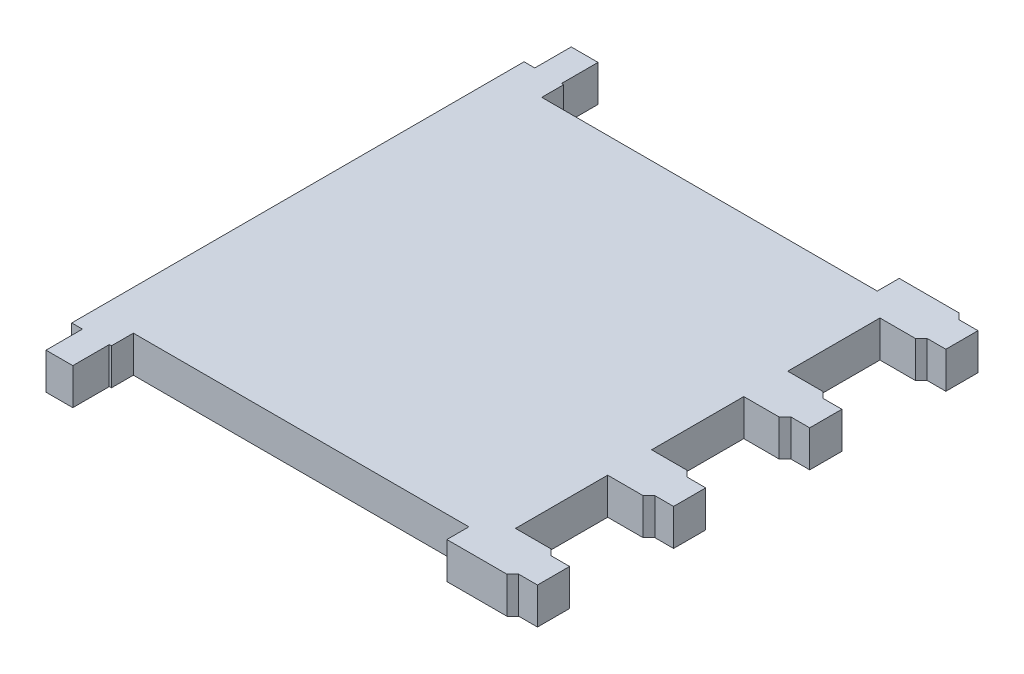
ISO-10303-21;
HEADER;
FILE_DESCRIPTION(('STEP AP214'),'2;1');
FILE_NAME('part.step','',(''),(''),'','','');
FILE_SCHEMA(('AUTOMOTIVE_DESIGN { 1 0 10303 214 1 1 1 1 }'));
ENDSEC;
DATA;
#1=APPLICATION_CONTEXT('core data for automotive mechanical design processes');
#2=APPLICATION_PROTOCOL_DEFINITION('international standard','automotive_design',2000,#1);
#3=PRODUCT_CONTEXT('',#1,'mechanical');
#4=PRODUCT('Part','Part','',(#3));
#5=PRODUCT_RELATED_PRODUCT_CATEGORY('part','',(#4));
#6=PRODUCT_DEFINITION_FORMATION('','',#4);
#7=PRODUCT_DEFINITION_CONTEXT('part definition',#1,'design');
#8=PRODUCT_DEFINITION('design','',#6,#7);
#9=PRODUCT_DEFINITION_SHAPE('','',#8);
#10=(LENGTH_UNIT() NAMED_UNIT(*) SI_UNIT(.MILLI.,.METRE.));
#11=(NAMED_UNIT(*) PLANE_ANGLE_UNIT() SI_UNIT($,.RADIAN.));
#12=(NAMED_UNIT(*) SI_UNIT($,.STERADIAN.) SOLID_ANGLE_UNIT());
#13=UNCERTAINTY_MEASURE_WITH_UNIT(LENGTH_MEASURE(1.E-05),#10,'distance_accuracy_value','');
#14=(GEOMETRIC_REPRESENTATION_CONTEXT(3) GLOBAL_UNCERTAINTY_ASSIGNED_CONTEXT((#13)) GLOBAL_UNIT_ASSIGNED_CONTEXT((#10,
#11,#12)) REPRESENTATION_CONTEXT('',''));
#15=CARTESIAN_POINT('',(0.,0.,0.));
#16=DIRECTION('',(0.,0.,1.));
#17=DIRECTION('',(1.,0.,0.));
#18=AXIS2_PLACEMENT_3D('',#15,#16,#17);
#19=CARTESIAN_POINT('',(0.,0.,0.));
#20=DIRECTION('',(0.,1.,0.));
#21=DIRECTION('',(0.,0.,1.));
#22=AXIS2_PLACEMENT_3D('',#19,#20,#21);
#23=PLANE('',#22);
#24=DIRECTION('',(-1.,0.,0.));
#25=VECTOR('',#24,1.);
#26=CARTESIAN_POINT('',(0.,0.,2.11));
#27=LINE('',#26,#25);
#28=CARTESIAN_POINT('',(-0.919999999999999,0.,2.11));
#29=VERTEX_POINT('',#28);
#30=CARTESIAN_POINT('',(-0.94,0.,2.11));
#31=VERTEX_POINT('',#30);
#32=EDGE_CURVE('E346',#29,#31,#27,.T.);
#33=ORIENTED_EDGE('',*,*,#32,.T.);
#34=DIRECTION('',(0.,0.,1.));
#35=VECTOR('',#34,1.);
#36=CARTESIAN_POINT('',(-0.94,0.,0.));
#37=LINE('',#36,#35);
#38=CARTESIAN_POINT('',(-0.94,0.,2.45));
#39=VERTEX_POINT('',#38);
#40=EDGE_CURVE('E342',#39,#31,#37,.F.);
#41=ORIENTED_EDGE('',*,*,#40,.F.);
#42=DIRECTION('',(1.,0.,0.));
#43=VECTOR('',#42,1.);
#44=CARTESIAN_POINT('',(0.,0.,2.45));
#45=LINE('',#44,#43);
#46=CARTESIAN_POINT('',(-1.19,0.,2.45));
#47=VERTEX_POINT('',#46);
#48=EDGE_CURVE('E341',#47,#39,#45,.T.);
#49=ORIENTED_EDGE('',*,*,#48,.F.);
#50=DIRECTION('',(0.,0.,1.));
#51=VECTOR('',#50,1.);
#52=CARTESIAN_POINT('',(-1.19,0.,0.));
#53=LINE('',#52,#51);
#54=CARTESIAN_POINT('',(-1.19,0.,2.11));
#55=VERTEX_POINT('',#54);
#56=EDGE_CURVE('E319',#55,#47,#53,.T.);
#57=ORIENTED_EDGE('',*,*,#56,.F.);
#58=DIRECTION('',(1.,0.,0.));
#59=VECTOR('',#58,1.);
#60=CARTESIAN_POINT('',(0.,0.,2.11));
#61=LINE('',#60,#59);
#62=CARTESIAN_POINT('',(-1.29,0.,2.11));
#63=VERTEX_POINT('',#62);
#64=EDGE_CURVE('E20',#63,#55,#61,.T.);
#65=ORIENTED_EDGE('',*,*,#64,.F.);
#66=DIRECTION('',(0.,0.,1.));
#67=VECTOR('',#66,1.);
#68=CARTESIAN_POINT('',(-1.29,0.,0.));
#69=LINE('',#68,#67);
#70=CARTESIAN_POINT('',(-1.29,0.,-2.11));
#71=VERTEX_POINT('',#70);
#72=EDGE_CURVE('E545',#71,#63,#69,.T.);
#73=ORIENTED_EDGE('',*,*,#72,.F.);
#74=DIRECTION('',(-1.,0.,0.));
#75=VECTOR('',#74,1.);
#76=CARTESIAN_POINT('',(0.,0.,-2.11));
#77=LINE('',#76,#75);
#78=CARTESIAN_POINT('',(-1.19,0.,-2.11));
#79=VERTEX_POINT('',#78);
#80=EDGE_CURVE('E540',#79,#71,#77,.T.);
#81=ORIENTED_EDGE('',*,*,#80,.F.);
#82=DIRECTION('',(0.,0.,1.));
#83=VECTOR('',#82,1.);
#84=CARTESIAN_POINT('',(-1.19,0.,0.));
#85=LINE('',#84,#83);
#86=CARTESIAN_POINT('',(-1.19,0.,-2.45));
#87=VERTEX_POINT('',#86);
#88=EDGE_CURVE('E535',#87,#79,#85,.T.);
#89=ORIENTED_EDGE('',*,*,#88,.F.);
#90=DIRECTION('',(-1.,0.,0.));
#91=VECTOR('',#90,1.);
#92=CARTESIAN_POINT('',(0.,0.,-2.45));
#93=LINE('',#92,#91);
#94=CARTESIAN_POINT('',(-0.94,0.,-2.45));
#95=VERTEX_POINT('',#94);
#96=EDGE_CURVE('E530',#95,#87,#93,.T.);
#97=ORIENTED_EDGE('',*,*,#96,.F.);
#98=DIRECTION('',(0.,0.,-1.));
#99=VECTOR('',#98,1.);
#100=CARTESIAN_POINT('',(-0.94,0.,0.));
#101=LINE('',#100,#99);
#102=CARTESIAN_POINT('',(-0.94,0.,-2.11));
#103=VERTEX_POINT('',#102);
#104=EDGE_CURVE('E525',#103,#95,#101,.T.);
#105=ORIENTED_EDGE('',*,*,#104,.F.);
#106=DIRECTION('',(-1.,0.,0.));
#107=VECTOR('',#106,1.);
#108=CARTESIAN_POINT('',(0.,0.,-2.11));
#109=LINE('',#108,#107);
#110=CARTESIAN_POINT('',(-0.919999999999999,0.,-2.11));
#111=VERTEX_POINT('',#110);
#112=EDGE_CURVE('E520',#111,#103,#109,.T.);
#113=ORIENTED_EDGE('',*,*,#112,.F.);
#114=DIRECTION('',(0.,0.,-1.));
#115=VECTOR('',#114,1.);
#116=CARTESIAN_POINT('',(-0.92,0.,0.));
#117=LINE('',#116,#115);
#118=CARTESIAN_POINT('',(-0.919999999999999,0.,-1.905));
#119=VERTEX_POINT('',#118);
#120=EDGE_CURVE('E515',#119,#111,#117,.T.);
#121=ORIENTED_EDGE('',*,*,#120,.F.);
#122=DIRECTION('',(-1.,0.,0.));
#123=VECTOR('',#122,1.);
#124=CARTESIAN_POINT('',(0.,0.,-1.905));
#125=LINE('',#124,#123);
#126=CARTESIAN_POINT('',(2.21,0.,-1.905));
#127=VERTEX_POINT('',#126);
#128=EDGE_CURVE('E510',#127,#119,#125,.T.);
#129=ORIENTED_EDGE('',*,*,#128,.F.);
#130=DIRECTION('',(0.,0.,-1.));
#131=VECTOR('',#130,1.);
#132=CARTESIAN_POINT('',(2.21,0.,0.));
#133=LINE('',#132,#131);
#134=CARTESIAN_POINT('',(2.21,0.,-2.11));
#135=VERTEX_POINT('',#134);
#136=EDGE_CURVE('E503',#127,#135,#133,.T.);
#137=ORIENTED_EDGE('',*,*,#136,.T.);
#138=DIRECTION('',(1.,0.,0.));
#139=VECTOR('',#138,1.);
#140=CARTESIAN_POINT('',(0.,0.,-2.11));
#141=LINE('',#140,#139);
#142=CARTESIAN_POINT('',(2.77,0.,-2.11));
#143=VERTEX_POINT('',#142);
#144=EDGE_CURVE('E499',#135,#143,#141,.T.);
#145=ORIENTED_EDGE('',*,*,#144,.T.);
#146=DIRECTION('',(0.707106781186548,0.,0.707106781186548));
#147=VECTOR('',#146,1.);
#148=CARTESIAN_POINT('',(2.44,0.,-2.44));
#149=LINE('',#148,#147);
#150=CARTESIAN_POINT('',(2.825,0.,-2.055));
#151=VERTEX_POINT('',#150);
#152=EDGE_CURVE('E495',#143,#151,#149,.T.);
#153=ORIENTED_EDGE('',*,*,#152,.T.);
#154=DIRECTION('',(1.,0.,0.));
#155=VECTOR('',#154,1.);
#156=CARTESIAN_POINT('',(0.,0.,-2.055));
#157=LINE('',#156,#155);
#158=CARTESIAN_POINT('',(3.,0.,-2.055));
#159=VERTEX_POINT('',#158);
#160=EDGE_CURVE('E491',#151,#159,#157,.T.);
#161=ORIENTED_EDGE('',*,*,#160,.T.);
#162=DIRECTION('',(0.,0.,1.));
#163=VECTOR('',#162,1.);
#164=CARTESIAN_POINT('',(3.,0.,0.));
#165=LINE('',#164,#163);
#166=CARTESIAN_POINT('',(3.,0.,-1.755));
#167=VERTEX_POINT('',#166);
#168=EDGE_CURVE('E487',#159,#167,#165,.T.);
#169=ORIENTED_EDGE('',*,*,#168,.T.);
#170=DIRECTION('',(-1.,0.,0.));
#171=VECTOR('',#170,1.);
#172=CARTESIAN_POINT('',(0.,0.,-1.755));
#173=LINE('',#172,#171);
#174=CARTESIAN_POINT('',(2.825,0.,-1.755));
#175=VERTEX_POINT('',#174);
#176=EDGE_CURVE('E483',#167,#175,#173,.T.);
#177=ORIENTED_EDGE('',*,*,#176,.T.);
#178=DIRECTION('',(-0.707106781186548,0.,0.707106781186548));
#179=VECTOR('',#178,1.);
#180=CARTESIAN_POINT('',(0.535,0.,0.535));
#181=LINE('',#180,#179);
#182=CARTESIAN_POINT('',(2.77,0.,-1.7));
#183=VERTEX_POINT('',#182);
#184=EDGE_CURVE('E479',#175,#183,#181,.T.);
#185=ORIENTED_EDGE('',*,*,#184,.T.);
#186=DIRECTION('',(-1.,0.,0.));
#187=VECTOR('',#186,1.);
#188=CARTESIAN_POINT('',(0.,0.,-1.7));
#189=LINE('',#188,#187);
#190=CARTESIAN_POINT('',(2.43999999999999,0.,-1.7));
#191=VERTEX_POINT('',#190);
#192=EDGE_CURVE('E475',#183,#191,#189,.T.);
#193=ORIENTED_EDGE('',*,*,#192,.T.);
#194=DIRECTION('',(0.,0.,-1.));
#195=VECTOR('',#194,1.);
#196=CARTESIAN_POINT('',(2.44,0.,0.));
#197=LINE('',#196,#195);
#198=CARTESIAN_POINT('',(2.44,0.,-0.840000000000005));
#199=VERTEX_POINT('',#198);
#200=EDGE_CURVE('E472',#199,#191,#197,.T.);
#201=ORIENTED_EDGE('',*,*,#200,.F.);
#202=DIRECTION('',(-1.,0.,0.));
#203=VECTOR('',#202,1.);
#204=CARTESIAN_POINT('',(0.,0.,-0.84));
#205=LINE('',#204,#203);
#206=CARTESIAN_POINT('',(2.77,0.,-0.840000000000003));
#207=VERTEX_POINT('',#206);
#208=EDGE_CURVE('E467',#207,#199,#205,.T.);
#209=ORIENTED_EDGE('',*,*,#208,.F.);
#210=DIRECTION('',(-0.707106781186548,0.,-0.707106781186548));
#211=VECTOR('',#210,1.);
#212=CARTESIAN_POINT('',(1.805,0.,-1.805));
#213=LINE('',#212,#211);
#214=CARTESIAN_POINT('',(2.825,0.,-0.784999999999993));
#215=VERTEX_POINT('',#214);
#216=EDGE_CURVE('E462',#215,#207,#213,.T.);
#217=ORIENTED_EDGE('',*,*,#216,.F.);
#218=DIRECTION('',(1.,0.,0.));
#219=VECTOR('',#218,1.);
#220=CARTESIAN_POINT('',(0.,0.,-0.785));
#221=LINE('',#220,#219);
#222=CARTESIAN_POINT('',(3.,0.,-0.784999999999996));
#223=VERTEX_POINT('',#222);
#224=EDGE_CURVE('E455',#215,#223,#221,.T.);
#225=ORIENTED_EDGE('',*,*,#224,.T.);
#226=DIRECTION('',(0.,0.,1.));
#227=VECTOR('',#226,1.);
#228=CARTESIAN_POINT('',(3.,0.,0.));
#229=LINE('',#228,#227);
#230=CARTESIAN_POINT('',(3.,0.,-0.484999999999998));
#231=VERTEX_POINT('',#230);
#232=EDGE_CURVE('E451',#223,#231,#229,.T.);
#233=ORIENTED_EDGE('',*,*,#232,.T.);
#234=DIRECTION('',(-1.,0.,0.));
#235=VECTOR('',#234,1.);
#236=CARTESIAN_POINT('',(0.,0.,-0.485));
#237=LINE('',#236,#235);
#238=CARTESIAN_POINT('',(2.825,0.,-0.484999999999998));
#239=VERTEX_POINT('',#238);
#240=EDGE_CURVE('E447',#231,#239,#237,.T.);
#241=ORIENTED_EDGE('',*,*,#240,.T.);
#242=DIRECTION('',(-0.707106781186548,0.,0.707106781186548));
#243=VECTOR('',#242,1.);
#244=CARTESIAN_POINT('',(1.17,0.,1.17));
#245=LINE('',#244,#243);
#246=CARTESIAN_POINT('',(2.77,0.,-0.429999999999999));
#247=VERTEX_POINT('',#246);
#248=EDGE_CURVE('E443',#239,#247,#245,.T.);
#249=ORIENTED_EDGE('',*,*,#248,.T.);
#250=DIRECTION('',(-1.,0.,0.));
#251=VECTOR('',#250,1.);
#252=CARTESIAN_POINT('',(0.,0.,-0.43));
#253=LINE('',#252,#251);
#254=CARTESIAN_POINT('',(2.44,0.,-0.43));
#255=VERTEX_POINT('',#254);
#256=EDGE_CURVE('E439',#247,#255,#253,.T.);
#257=ORIENTED_EDGE('',*,*,#256,.T.);
#258=DIRECTION('',(0.,0.,1.));
#259=VECTOR('',#258,1.);
#260=CARTESIAN_POINT('',(2.44,0.,0.));
#261=LINE('',#260,#259);
#262=CARTESIAN_POINT('',(2.44,0.,0.43));
#263=VERTEX_POINT('',#262);
#264=EDGE_CURVE('E435',#255,#263,#261,.T.);
#265=ORIENTED_EDGE('',*,*,#264,.T.);
#266=DIRECTION('',(-1.,0.,0.));
#267=VECTOR('',#266,1.);
#268=CARTESIAN_POINT('',(0.,0.,0.43));
#269=LINE('',#268,#267);
#270=CARTESIAN_POINT('',(2.77,0.,0.429999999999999));
#271=VERTEX_POINT('',#270);
#272=EDGE_CURVE('E432',#271,#263,#269,.T.);
#273=ORIENTED_EDGE('',*,*,#272,.F.);
#274=DIRECTION('',(-0.707106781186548,0.,-0.707106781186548));
#275=VECTOR('',#274,1.);
#276=CARTESIAN_POINT('',(1.17,0.,-1.17));
#277=LINE('',#276,#275);
#278=CARTESIAN_POINT('',(2.825,0.,0.484999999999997));
#279=VERTEX_POINT('',#278);
#280=EDGE_CURVE('E427',#279,#271,#277,.T.);
#281=ORIENTED_EDGE('',*,*,#280,.F.);
#282=DIRECTION('',(-1.,0.,0.));
#283=VECTOR('',#282,1.);
#284=CARTESIAN_POINT('',(0.,0.,0.485));
#285=LINE('',#284,#283);
#286=CARTESIAN_POINT('',(3.,0.,0.484999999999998));
#287=VERTEX_POINT('',#286);
#288=EDGE_CURVE('E422',#287,#279,#285,.T.);
#289=ORIENTED_EDGE('',*,*,#288,.F.);
#290=DIRECTION('',(0.,0.,-1.));
#291=VECTOR('',#290,1.);
#292=CARTESIAN_POINT('',(3.,0.,0.));
#293=LINE('',#292,#291);
#294=CARTESIAN_POINT('',(3.,0.,0.784999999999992));
#295=VERTEX_POINT('',#294);
#296=EDGE_CURVE('E417',#295,#287,#293,.T.);
#297=ORIENTED_EDGE('',*,*,#296,.F.);
#298=DIRECTION('',(1.,0.,0.));
#299=VECTOR('',#298,1.);
#300=CARTESIAN_POINT('',(0.,0.,0.785));
#301=LINE('',#300,#299);
#302=CARTESIAN_POINT('',(2.825,0.,0.784999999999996));
#303=VERTEX_POINT('',#302);
#304=EDGE_CURVE('E412',#303,#295,#301,.T.);
#305=ORIENTED_EDGE('',*,*,#304,.F.);
#306=DIRECTION('',(-0.707106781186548,0.,0.707106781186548));
#307=VECTOR('',#306,1.);
#308=CARTESIAN_POINT('',(1.805,0.,1.805));
#309=LINE('',#308,#307);
#310=CARTESIAN_POINT('',(2.77,0.,0.840000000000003));
#311=VERTEX_POINT('',#310);
#312=EDGE_CURVE('E405',#303,#311,#309,.T.);
#313=ORIENTED_EDGE('',*,*,#312,.T.);
#314=DIRECTION('',(-1.,0.,0.));
#315=VECTOR('',#314,1.);
#316=CARTESIAN_POINT('',(0.,0.,0.84));
#317=LINE('',#316,#315);
#318=CARTESIAN_POINT('',(2.44,0.,0.840000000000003));
#319=VERTEX_POINT('',#318);
#320=EDGE_CURVE('E401',#311,#319,#317,.T.);
#321=ORIENTED_EDGE('',*,*,#320,.T.);
#322=DIRECTION('',(0.,0.,1.));
#323=VECTOR('',#322,1.);
#324=CARTESIAN_POINT('',(2.44,0.,0.));
#325=LINE('',#324,#323);
#326=CARTESIAN_POINT('',(2.43999999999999,0.,1.7));
#327=VERTEX_POINT('',#326);
#328=EDGE_CURVE('E397',#319,#327,#325,.T.);
#329=ORIENTED_EDGE('',*,*,#328,.T.);
#330=DIRECTION('',(-1.,0.,0.));
#331=VECTOR('',#330,1.);
#332=CARTESIAN_POINT('',(0.,0.,1.7));
#333=LINE('',#332,#331);
#334=CARTESIAN_POINT('',(2.77,0.,1.7));
#335=VERTEX_POINT('',#334);
#336=EDGE_CURVE('E394',#335,#327,#333,.T.);
#337=ORIENTED_EDGE('',*,*,#336,.F.);
#338=DIRECTION('',(-0.707106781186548,0.,-0.707106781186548));
#339=VECTOR('',#338,1.);
#340=CARTESIAN_POINT('',(0.535,0.,-0.535));
#341=LINE('',#340,#339);
#342=CARTESIAN_POINT('',(2.825,0.,1.755));
#343=VERTEX_POINT('',#342);
#344=EDGE_CURVE('E389',#343,#335,#341,.T.);
#345=ORIENTED_EDGE('',*,*,#344,.F.);
#346=DIRECTION('',(-1.,0.,0.));
#347=VECTOR('',#346,1.);
#348=CARTESIAN_POINT('',(0.,0.,1.755));
#349=LINE('',#348,#347);
#350=CARTESIAN_POINT('',(3.,0.,1.755));
#351=VERTEX_POINT('',#350);
#352=EDGE_CURVE('E384',#351,#343,#349,.T.);
#353=ORIENTED_EDGE('',*,*,#352,.F.);
#354=DIRECTION('',(0.,0.,-1.));
#355=VECTOR('',#354,1.);
#356=CARTESIAN_POINT('',(3.,0.,0.));
#357=LINE('',#356,#355);
#358=CARTESIAN_POINT('',(3.,0.,2.05499999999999));
#359=VERTEX_POINT('',#358);
#360=EDGE_CURVE('E379',#359,#351,#357,.T.);
#361=ORIENTED_EDGE('',*,*,#360,.F.);
#362=DIRECTION('',(1.,0.,0.));
#363=VECTOR('',#362,1.);
#364=CARTESIAN_POINT('',(0.,0.,2.055));
#365=LINE('',#364,#363);
#366=CARTESIAN_POINT('',(2.825,0.,2.055));
#367=VERTEX_POINT('',#366);
#368=EDGE_CURVE('E374',#367,#359,#365,.T.);
#369=ORIENTED_EDGE('',*,*,#368,.F.);
#370=DIRECTION('',(0.707106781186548,0.,-0.707106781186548));
#371=VECTOR('',#370,1.);
#372=CARTESIAN_POINT('',(2.44,0.,2.44));
#373=LINE('',#372,#371);
#374=CARTESIAN_POINT('',(2.77,0.,2.11));
#375=VERTEX_POINT('',#374);
#376=EDGE_CURVE('E369',#375,#367,#373,.T.);
#377=ORIENTED_EDGE('',*,*,#376,.F.);
#378=DIRECTION('',(1.,0.,0.));
#379=VECTOR('',#378,1.);
#380=CARTESIAN_POINT('',(0.,0.,2.11));
#381=LINE('',#380,#379);
#382=CARTESIAN_POINT('',(2.21,0.,2.11));
#383=VERTEX_POINT('',#382);
#384=EDGE_CURVE('E364',#383,#375,#381,.T.);
#385=ORIENTED_EDGE('',*,*,#384,.F.);
#386=DIRECTION('',(0.,0.,1.));
#387=VECTOR('',#386,1.);
#388=CARTESIAN_POINT('',(2.21,0.,0.));
#389=LINE('',#388,#387);
#390=CARTESIAN_POINT('',(2.21,0.,1.905));
#391=VERTEX_POINT('',#390);
#392=EDGE_CURVE('E359',#391,#383,#389,.T.);
#393=ORIENTED_EDGE('',*,*,#392,.F.);
#394=DIRECTION('',(-1.,0.,0.));
#395=VECTOR('',#394,1.);
#396=CARTESIAN_POINT('',(0.,0.,1.905));
#397=LINE('',#396,#395);
#398=CARTESIAN_POINT('',(-0.919999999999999,0.,1.905));
#399=VERTEX_POINT('',#398);
#400=EDGE_CURVE('E352',#391,#399,#397,.T.);
#401=ORIENTED_EDGE('',*,*,#400,.T.);
#402=DIRECTION('',(0.,0.,1.));
#403=VECTOR('',#402,1.);
#404=CARTESIAN_POINT('',(-0.92,0.,0.));
#405=LINE('',#404,#403);
#406=EDGE_CURVE('E348',#399,#29,#405,.T.);
#407=ORIENTED_EDGE('',*,*,#406,.T.);
#408=EDGE_LOOP('',(#33,#41,#49,#57,#65,#73,#81,#89,#97,#105,#113,#121,#129,#137,#145,#153,#161,
#169,#177,#185,#193,#201,#209,#217,#225,#233,#241,#249,#257,#265,#273,#281,#289,#297,#305,#313,
#321,#329,#337,#345,#353,#361,#369,#377,#385,#393,#401,#407));
#409=FACE_BOUND('',#408,.T.);
#410=ADVANCED_FACE('F17',(#409),#23,.F.);
#411=CARTESIAN_POINT('',(0.,6.852610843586,2.11));
#412=DIRECTION('',(0.,0.,-1.));
#413=DIRECTION('',(-1.,0.,0.));
#414=AXIS2_PLACEMENT_3D('',#411,#412,#413);
#415=PLANE('',#414);
#416=DIRECTION('',(0.,1.,0.));
#417=VECTOR('',#416,1.);
#418=CARTESIAN_POINT('',(-0.939999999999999,6.852610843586,2.11));
#419=LINE('',#418,#417);
#420=CARTESIAN_POINT('',(-0.94,0.34,2.11));
#421=VERTEX_POINT('',#420);
#422=EDGE_CURVE('E549',#421,#31,#419,.F.);
#423=ORIENTED_EDGE('',*,*,#422,.T.);
#424=ORIENTED_EDGE('',*,*,#32,.F.);
#425=DIRECTION('',(0.,1.,0.));
#426=VECTOR('',#425,1.);
#427=CARTESIAN_POINT('',(-0.919999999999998,6.852610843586,2.11));
#428=LINE('',#427,#426);
#429=CARTESIAN_POINT('',(-0.919999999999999,0.34,2.11));
#430=VERTEX_POINT('',#429);
#431=EDGE_CURVE('E350',#29,#430,#428,.T.);
#432=ORIENTED_EDGE('',*,*,#431,.T.);
#433=DIRECTION('',(1.,0.,0.));
#434=VECTOR('',#433,1.);
#435=CARTESIAN_POINT('',(0.,0.34,2.11));
#436=LINE('',#435,#434);
#437=EDGE_CURVE('E553',#421,#430,#436,.T.);
#438=ORIENTED_EDGE('',*,*,#437,.F.);
#439=EDGE_LOOP('',(#423,#424,#432,#438));
#440=FACE_BOUND('',#439,.T.);
#441=ADVANCED_FACE('F699',(#440),#415,.F.);
#442=CARTESIAN_POINT('',(-0.92,6.852610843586,0.));
#443=DIRECTION('',(-1.,0.,0.));
#444=DIRECTION('',(0.,0.,1.));
#445=AXIS2_PLACEMENT_3D('',#442,#443,#444);
#446=PLANE('',#445);
#447=ORIENTED_EDGE('',*,*,#431,.F.);
#448=ORIENTED_EDGE('',*,*,#406,.F.);
#449=DIRECTION('',(0.,1.,0.));
#450=VECTOR('',#449,1.);
#451=CARTESIAN_POINT('',(-0.92,6.852610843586,1.905));
#452=LINE('',#451,#450);
#453=CARTESIAN_POINT('',(-0.919999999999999,0.34,1.905));
#454=VERTEX_POINT('',#453);
#455=EDGE_CURVE('E354',#399,#454,#452,.T.);
#456=ORIENTED_EDGE('',*,*,#455,.T.);
#457=DIRECTION('',(0.,0.,1.));
#458=VECTOR('',#457,1.);
#459=CARTESIAN_POINT('',(-0.92,0.34,0.));
#460=LINE('',#459,#458);
#461=EDGE_CURVE('E556',#430,#454,#460,.F.);
#462=ORIENTED_EDGE('',*,*,#461,.F.);
#463=EDGE_LOOP('',(#447,#448,#456,#462));
#464=FACE_BOUND('',#463,.T.);
#465=ADVANCED_FACE('F703',(#464),#446,.F.);
#466=CARTESIAN_POINT('',(0.,6.852610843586,1.905));
#467=DIRECTION('',(0.,0.,-1.));
#468=DIRECTION('',(-1.,0.,0.));
#469=AXIS2_PLACEMENT_3D('',#466,#467,#468);
#470=PLANE('',#469);
#471=ORIENTED_EDGE('',*,*,#455,.F.);
#472=ORIENTED_EDGE('',*,*,#400,.F.);
#473=DIRECTION('',(0.,1.,0.));
#474=VECTOR('',#473,1.);
#475=CARTESIAN_POINT('',(2.21,6.852610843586,1.905));
#476=LINE('',#475,#474);
#477=CARTESIAN_POINT('',(2.21,0.34,1.905));
#478=VERTEX_POINT('',#477);
#479=EDGE_CURVE('E356',#478,#391,#476,.F.);
#480=ORIENTED_EDGE('',*,*,#479,.F.);
#481=DIRECTION('',(1.,0.,0.));
#482=VECTOR('',#481,1.);
#483=CARTESIAN_POINT('',(0.,0.34,1.905));
#484=LINE('',#483,#482);
#485=EDGE_CURVE('E559',#454,#478,#484,.T.);
#486=ORIENTED_EDGE('',*,*,#485,.F.);
#487=EDGE_LOOP('',(#471,#472,#480,#486));
#488=FACE_BOUND('',#487,.T.);
#489=ADVANCED_FACE('F706',(#488),#470,.F.);
#490=CARTESIAN_POINT('',(2.21,6.852610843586,0.));
#491=DIRECTION('',(-1.,0.,0.));
#492=DIRECTION('',(0.,0.,1.));
#493=AXIS2_PLACEMENT_3D('',#490,#491,#492);
#494=PLANE('',#493);
#495=ORIENTED_EDGE('',*,*,#479,.T.);
#496=ORIENTED_EDGE('',*,*,#392,.T.);
#497=DIRECTION('',(0.,1.,0.));
#498=VECTOR('',#497,1.);
#499=CARTESIAN_POINT('',(2.21,6.852610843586,2.11));
#500=LINE('',#499,#498);
#501=CARTESIAN_POINT('',(2.21,0.34,2.11));
#502=VERTEX_POINT('',#501);
#503=EDGE_CURVE('E361',#502,#383,#500,.F.);
#504=ORIENTED_EDGE('',*,*,#503,.F.);
#505=DIRECTION('',(0.,0.,1.));
#506=VECTOR('',#505,1.);
#507=CARTESIAN_POINT('',(2.21,0.34,0.));
#508=LINE('',#507,#506);
#509=EDGE_CURVE('E562',#478,#502,#508,.T.);
#510=ORIENTED_EDGE('',*,*,#509,.F.);
#511=EDGE_LOOP('',(#495,#496,#504,#510));
#512=FACE_BOUND('',#511,.T.);
#513=ADVANCED_FACE('F710',(#512),#494,.T.);
#514=CARTESIAN_POINT('',(0.,6.852610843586,2.11));
#515=DIRECTION('',(0.,0.,1.));
#516=DIRECTION('',(1.,0.,0.));
#517=AXIS2_PLACEMENT_3D('',#514,#515,#516);
#518=PLANE('',#517);
#519=ORIENTED_EDGE('',*,*,#503,.T.);
#520=ORIENTED_EDGE('',*,*,#384,.T.);
#521=DIRECTION('',(0.,1.,0.));
#522=VECTOR('',#521,1.);
#523=CARTESIAN_POINT('',(2.77,6.852610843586,2.11));
#524=LINE('',#523,#522);
#525=CARTESIAN_POINT('',(2.77,0.339999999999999,2.11));
#526=VERTEX_POINT('',#525);
#527=EDGE_CURVE('E366',#526,#375,#524,.F.);
#528=ORIENTED_EDGE('',*,*,#527,.F.);
#529=DIRECTION('',(1.,0.,0.));
#530=VECTOR('',#529,1.);
#531=CARTESIAN_POINT('',(0.,0.34,2.11));
#532=LINE('',#531,#530);
#533=EDGE_CURVE('E565',#502,#526,#532,.T.);
#534=ORIENTED_EDGE('',*,*,#533,.F.);
#535=EDGE_LOOP('',(#519,#520,#528,#534));
#536=FACE_BOUND('',#535,.T.);
#537=ADVANCED_FACE('F714',(#536),#518,.T.);
#538=CARTESIAN_POINT('',(2.44,6.852610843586,2.44));
#539=DIRECTION('',(0.707106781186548,0.,0.707106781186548));
#540=DIRECTION('',(0.707106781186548,0.,-0.707106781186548));
#541=AXIS2_PLACEMENT_3D('',#538,#539,#540);
#542=PLANE('',#541);
#543=ORIENTED_EDGE('',*,*,#527,.T.);
#544=ORIENTED_EDGE('',*,*,#376,.T.);
#545=DIRECTION('',(0.,1.,0.));
#546=VECTOR('',#545,1.);
#547=CARTESIAN_POINT('',(2.825,6.852610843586,2.05499999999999));
#548=LINE('',#547,#546);
#549=CARTESIAN_POINT('',(2.825,0.339999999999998,2.055));
#550=VERTEX_POINT('',#549);
#551=EDGE_CURVE('E371',#550,#367,#548,.F.);
#552=ORIENTED_EDGE('',*,*,#551,.F.);
#553=DIRECTION('',(0.707106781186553,0.,-0.707106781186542));
#554=VECTOR('',#553,1.);
#555=CARTESIAN_POINT('',(2.77,0.34,2.11));
#556=LINE('',#555,#554);
#557=EDGE_CURVE('E568',#526,#550,#556,.T.);
#558=ORIENTED_EDGE('',*,*,#557,.F.);
#559=EDGE_LOOP('',(#543,#544,#552,#558));
#560=FACE_BOUND('',#559,.T.);
#561=ADVANCED_FACE('F718',(#560),#542,.T.);
#562=CARTESIAN_POINT('',(0.,6.852610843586,2.055));
#563=DIRECTION('',(0.,0.,1.));
#564=DIRECTION('',(1.,0.,0.));
#565=AXIS2_PLACEMENT_3D('',#562,#563,#564);
#566=PLANE('',#565);
#567=ORIENTED_EDGE('',*,*,#551,.T.);
#568=ORIENTED_EDGE('',*,*,#368,.T.);
#569=DIRECTION('',(0.,1.,0.));
#570=VECTOR('',#569,1.);
#571=CARTESIAN_POINT('',(3.,6.852610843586,2.055));
#572=LINE('',#571,#570);
#573=CARTESIAN_POINT('',(3.,0.34,2.05499999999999));
#574=VERTEX_POINT('',#573);
#575=EDGE_CURVE('E376',#574,#359,#572,.F.);
#576=ORIENTED_EDGE('',*,*,#575,.F.);
#577=DIRECTION('',(1.,0.,0.));
#578=VECTOR('',#577,1.);
#579=CARTESIAN_POINT('',(0.,0.34,2.055));
#580=LINE('',#579,#578);
#581=EDGE_CURVE('E571',#550,#574,#580,.T.);
#582=ORIENTED_EDGE('',*,*,#581,.F.);
#583=EDGE_LOOP('',(#567,#568,#576,#582));
#584=FACE_BOUND('',#583,.T.);
#585=ADVANCED_FACE('F722',(#584),#566,.T.);
#586=CARTESIAN_POINT('',(3.,6.852610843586,0.));
#587=DIRECTION('',(1.,0.,0.));
#588=DIRECTION('',(0.,0.,-1.));
#589=AXIS2_PLACEMENT_3D('',#586,#587,#588);
#590=PLANE('',#589);
#591=ORIENTED_EDGE('',*,*,#575,.T.);
#592=ORIENTED_EDGE('',*,*,#360,.T.);
#593=DIRECTION('',(0.,1.,0.));
#594=VECTOR('',#593,1.);
#595=CARTESIAN_POINT('',(3.,6.852610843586,1.75499999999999));
#596=LINE('',#595,#594);
#597=CARTESIAN_POINT('',(3.,0.34,1.755));
#598=VERTEX_POINT('',#597);
#599=EDGE_CURVE('E381',#598,#351,#596,.F.);
#600=ORIENTED_EDGE('',*,*,#599,.F.);
#601=DIRECTION('',(0.,0.,1.));
#602=VECTOR('',#601,1.);
#603=CARTESIAN_POINT('',(3.,0.34,0.));
#604=LINE('',#603,#602);
#605=EDGE_CURVE('E574',#574,#598,#604,.F.);
#606=ORIENTED_EDGE('',*,*,#605,.F.);
#607=EDGE_LOOP('',(#591,#592,#600,#606));
#608=FACE_BOUND('',#607,.T.);
#609=ADVANCED_FACE('F726',(#608),#590,.T.);
#610=CARTESIAN_POINT('',(0.,6.852610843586,1.755));
#611=DIRECTION('',(0.,0.,-1.));
#612=DIRECTION('',(-1.,0.,0.));
#613=AXIS2_PLACEMENT_3D('',#610,#611,#612);
#614=PLANE('',#613);
#615=ORIENTED_EDGE('',*,*,#599,.T.);
#616=ORIENTED_EDGE('',*,*,#352,.T.);
#617=DIRECTION('',(0.,1.,0.));
#618=VECTOR('',#617,1.);
#619=CARTESIAN_POINT('',(2.825,6.852610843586,1.755));
#620=LINE('',#619,#618);
#621=CARTESIAN_POINT('',(2.825,0.339999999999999,1.755));
#622=VERTEX_POINT('',#621);
#623=EDGE_CURVE('E386',#622,#343,#620,.F.);
#624=ORIENTED_EDGE('',*,*,#623,.F.);
#625=DIRECTION('',(1.,0.,0.));
#626=VECTOR('',#625,1.);
#627=CARTESIAN_POINT('',(0.,0.34,1.755));
#628=LINE('',#627,#626);
#629=EDGE_CURVE('E577',#598,#622,#628,.F.);
#630=ORIENTED_EDGE('',*,*,#629,.F.);
#631=EDGE_LOOP('',(#615,#616,#624,#630));
#632=FACE_BOUND('',#631,.T.);
#633=ADVANCED_FACE('F730',(#632),#614,.T.);
#634=CARTESIAN_POINT('',(0.535,6.852610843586,-0.535));
#635=DIRECTION('',(0.707106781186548,0.,-0.707106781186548));
#636=DIRECTION('',(-0.707106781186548,0.,-0.707106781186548));
#637=AXIS2_PLACEMENT_3D('',#634,#635,#636);
#638=PLANE('',#637);
#639=ORIENTED_EDGE('',*,*,#623,.T.);
#640=ORIENTED_EDGE('',*,*,#344,.T.);
#641=DIRECTION('',(0.,1.,0.));
#642=VECTOR('',#641,1.);
#643=CARTESIAN_POINT('',(2.77,6.852610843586,1.7));
#644=LINE('',#643,#642);
#645=CARTESIAN_POINT('',(2.77,0.339999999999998,1.7));
#646=VERTEX_POINT('',#645);
#647=EDGE_CURVE('E391',#646,#335,#644,.F.);
#648=ORIENTED_EDGE('',*,*,#647,.F.);
#649=DIRECTION('',(-0.70710678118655,0.,-0.707106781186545));
#650=VECTOR('',#649,1.);
#651=CARTESIAN_POINT('',(2.825,0.34,1.755));
#652=LINE('',#651,#650);
#653=EDGE_CURVE('E580',#622,#646,#652,.T.);
#654=ORIENTED_EDGE('',*,*,#653,.F.);
#655=EDGE_LOOP('',(#639,#640,#648,#654));
#656=FACE_BOUND('',#655,.T.);
#657=ADVANCED_FACE('F734',(#656),#638,.T.);
#658=CARTESIAN_POINT('',(0.,6.852610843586,1.7));
#659=DIRECTION('',(0.,0.,-1.));
#660=DIRECTION('',(-1.,0.,0.));
#661=AXIS2_PLACEMENT_3D('',#658,#659,#660);
#662=PLANE('',#661);
#663=ORIENTED_EDGE('',*,*,#647,.T.);
#664=ORIENTED_EDGE('',*,*,#336,.T.);
#665=DIRECTION('',(0.,1.,0.));
#666=VECTOR('',#665,1.);
#667=CARTESIAN_POINT('',(2.43999999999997,6.852610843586,1.7));
#668=LINE('',#667,#666);
#669=CARTESIAN_POINT('',(2.43999999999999,0.34,1.7));
#670=VERTEX_POINT('',#669);
#671=EDGE_CURVE('E399',#327,#670,#668,.T.);
#672=ORIENTED_EDGE('',*,*,#671,.T.);
#673=DIRECTION('',(1.,0.,0.));
#674=VECTOR('',#673,1.);
#675=CARTESIAN_POINT('',(0.,0.34,1.7));
#676=LINE('',#675,#674);
#677=EDGE_CURVE('E583',#646,#670,#676,.F.);
#678=ORIENTED_EDGE('',*,*,#677,.F.);
#679=EDGE_LOOP('',(#663,#664,#672,#678));
#680=FACE_BOUND('',#679,.T.);
#681=ADVANCED_FACE('F738',(#680),#662,.T.);
#682=CARTESIAN_POINT('',(2.44,6.852610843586,0.));
#683=DIRECTION('',(-1.,0.,0.));
#684=DIRECTION('',(0.,0.,1.));
#685=AXIS2_PLACEMENT_3D('',#682,#683,#684);
#686=PLANE('',#685);
#687=ORIENTED_EDGE('',*,*,#671,.F.);
#688=ORIENTED_EDGE('',*,*,#328,.F.);
#689=DIRECTION('',(0.,1.,0.));
#690=VECTOR('',#689,1.);
#691=CARTESIAN_POINT('',(2.44,6.852610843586,0.84000000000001));
#692=LINE('',#691,#690);
#693=CARTESIAN_POINT('',(2.43999999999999,0.34,0.840000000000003));
#694=VERTEX_POINT('',#693);
#695=EDGE_CURVE('E403',#319,#694,#692,.T.);
#696=ORIENTED_EDGE('',*,*,#695,.T.);
#697=DIRECTION('',(0.,0.,1.));
#698=VECTOR('',#697,1.);
#699=CARTESIAN_POINT('',(2.44,0.34,0.));
#700=LINE('',#699,#698);
#701=EDGE_CURVE('E586',#670,#694,#700,.F.);
#702=ORIENTED_EDGE('',*,*,#701,.F.);
#703=EDGE_LOOP('',(#687,#688,#696,#702));
#704=FACE_BOUND('',#703,.T.);
#705=ADVANCED_FACE('F743',(#704),#686,.F.);
#706=CARTESIAN_POINT('',(0.,6.852610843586,0.84));
#707=DIRECTION('',(0.,0.,-1.));
#708=DIRECTION('',(-1.,0.,0.));
#709=AXIS2_PLACEMENT_3D('',#706,#707,#708);
#710=PLANE('',#709);
#711=ORIENTED_EDGE('',*,*,#695,.F.);
#712=ORIENTED_EDGE('',*,*,#320,.F.);
#713=DIRECTION('',(0.,1.,0.));
#714=VECTOR('',#713,1.);
#715=CARTESIAN_POINT('',(2.77,6.852610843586,0.84));
#716=LINE('',#715,#714);
#717=CARTESIAN_POINT('',(2.77,0.339999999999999,0.840000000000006));
#718=VERTEX_POINT('',#717);
#719=EDGE_CURVE('E407',#311,#718,#716,.T.);
#720=ORIENTED_EDGE('',*,*,#719,.T.);
#721=DIRECTION('',(1.,0.,0.));
#722=VECTOR('',#721,1.);
#723=CARTESIAN_POINT('',(0.,0.34,0.84));
#724=LINE('',#723,#722);
#725=EDGE_CURVE('E589',#694,#718,#724,.T.);
#726=ORIENTED_EDGE('',*,*,#725,.F.);
#727=EDGE_LOOP('',(#711,#712,#720,#726));
#728=FACE_BOUND('',#727,.T.);
#729=ADVANCED_FACE('F748',(#728),#710,.F.);
#730=CARTESIAN_POINT('',(1.805,6.852610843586,1.805));
#731=DIRECTION('',(-0.707106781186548,0.,-0.707106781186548));
#732=DIRECTION('',(-0.707106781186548,0.,0.707106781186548));
#733=AXIS2_PLACEMENT_3D('',#730,#731,#732);
#734=PLANE('',#733);
#735=ORIENTED_EDGE('',*,*,#719,.F.);
#736=ORIENTED_EDGE('',*,*,#312,.F.);
#737=DIRECTION('',(0.,1.,0.));
#738=VECTOR('',#737,1.);
#739=CARTESIAN_POINT('',(2.825,6.852610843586,0.784999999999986));
#740=LINE('',#739,#738);
#741=CARTESIAN_POINT('',(2.825,0.339999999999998,0.784999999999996));
#742=VERTEX_POINT('',#741);
#743=EDGE_CURVE('E409',#742,#303,#740,.F.);
#744=ORIENTED_EDGE('',*,*,#743,.F.);
#745=DIRECTION('',(0.70710678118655,0.,-0.707106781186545));
#746=VECTOR('',#745,1.);
#747=CARTESIAN_POINT('',(2.77,0.34,0.84));
#748=LINE('',#747,#746);
#749=EDGE_CURVE('E592',#718,#742,#748,.T.);
#750=ORIENTED_EDGE('',*,*,#749,.F.);
#751=EDGE_LOOP('',(#735,#736,#744,#750));
#752=FACE_BOUND('',#751,.T.);
#753=ADVANCED_FACE('F753',(#752),#734,.F.);
#754=CARTESIAN_POINT('',(0.,6.852610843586,0.785));
#755=DIRECTION('',(0.,0.,1.));
#756=DIRECTION('',(1.,0.,0.));
#757=AXIS2_PLACEMENT_3D('',#754,#755,#756);
#758=PLANE('',#757);
#759=ORIENTED_EDGE('',*,*,#743,.T.);
#760=ORIENTED_EDGE('',*,*,#304,.T.);
#761=DIRECTION('',(0.,1.,0.));
#762=VECTOR('',#761,1.);
#763=CARTESIAN_POINT('',(3.,6.852610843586,0.785));
#764=LINE('',#763,#762);
#765=CARTESIAN_POINT('',(3.,0.34,0.784999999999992));
#766=VERTEX_POINT('',#765);
#767=EDGE_CURVE('E414',#766,#295,#764,.F.);
#768=ORIENTED_EDGE('',*,*,#767,.F.);
#769=DIRECTION('',(1.,0.,0.));
#770=VECTOR('',#769,1.);
#771=CARTESIAN_POINT('',(0.,0.34,0.785));
#772=LINE('',#771,#770);
#773=EDGE_CURVE('E595',#742,#766,#772,.T.);
#774=ORIENTED_EDGE('',*,*,#773,.F.);
#775=EDGE_LOOP('',(#759,#760,#768,#774));
#776=FACE_BOUND('',#775,.T.);
#777=ADVANCED_FACE('F756',(#776),#758,.T.);
#778=CARTESIAN_POINT('',(3.,6.852610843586,0.));
#779=DIRECTION('',(1.,0.,0.));
#780=DIRECTION('',(0.,0.,-1.));
#781=AXIS2_PLACEMENT_3D('',#778,#779,#780);
#782=PLANE('',#781);
#783=ORIENTED_EDGE('',*,*,#767,.T.);
#784=ORIENTED_EDGE('',*,*,#296,.T.);
#785=DIRECTION('',(0.,1.,0.));
#786=VECTOR('',#785,1.);
#787=CARTESIAN_POINT('',(3.,6.852610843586,0.484999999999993));
#788=LINE('',#787,#786);
#789=CARTESIAN_POINT('',(3.,0.34,0.484999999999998));
#790=VERTEX_POINT('',#789);
#791=EDGE_CURVE('E419',#790,#287,#788,.F.);
#792=ORIENTED_EDGE('',*,*,#791,.F.);
#793=DIRECTION('',(0.,0.,1.));
#794=VECTOR('',#793,1.);
#795=CARTESIAN_POINT('',(3.,0.34,0.));
#796=LINE('',#795,#794);
#797=EDGE_CURVE('E598',#766,#790,#796,.F.);
#798=ORIENTED_EDGE('',*,*,#797,.F.);
#799=EDGE_LOOP('',(#783,#784,#792,#798));
#800=FACE_BOUND('',#799,.T.);
#801=ADVANCED_FACE('F760',(#800),#782,.T.);
#802=CARTESIAN_POINT('',(0.,6.852610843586,0.485));
#803=DIRECTION('',(0.,0.,-1.));
#804=DIRECTION('',(-1.,0.,0.));
#805=AXIS2_PLACEMENT_3D('',#802,#803,#804);
#806=PLANE('',#805);
#807=ORIENTED_EDGE('',*,*,#791,.T.);
#808=ORIENTED_EDGE('',*,*,#288,.T.);
#809=DIRECTION('',(0.,1.,0.));
#810=VECTOR('',#809,1.);
#811=CARTESIAN_POINT('',(2.825,6.852610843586,0.485));
#812=LINE('',#811,#810);
#813=CARTESIAN_POINT('',(2.825,0.339999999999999,0.484999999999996));
#814=VERTEX_POINT('',#813);
#815=EDGE_CURVE('E424',#814,#279,#812,.F.);
#816=ORIENTED_EDGE('',*,*,#815,.F.);
#817=DIRECTION('',(1.,0.,0.));
#818=VECTOR('',#817,1.);
#819=CARTESIAN_POINT('',(0.,0.34,0.485));
#820=LINE('',#819,#818);
#821=EDGE_CURVE('E601',#790,#814,#820,.F.);
#822=ORIENTED_EDGE('',*,*,#821,.F.);
#823=EDGE_LOOP('',(#807,#808,#816,#822));
#824=FACE_BOUND('',#823,.T.);
#825=ADVANCED_FACE('F764',(#824),#806,.T.);
#826=CARTESIAN_POINT('',(1.17,6.852610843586,-1.17));
#827=DIRECTION('',(0.707106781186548,0.,-0.707106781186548));
#828=DIRECTION('',(-0.707106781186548,0.,-0.707106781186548));
#829=AXIS2_PLACEMENT_3D('',#826,#827,#828);
#830=PLANE('',#829);
#831=ORIENTED_EDGE('',*,*,#815,.T.);
#832=ORIENTED_EDGE('',*,*,#280,.T.);
#833=DIRECTION('',(0.,1.,0.));
#834=VECTOR('',#833,1.);
#835=CARTESIAN_POINT('',(2.77,6.852610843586,0.429999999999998));
#836=LINE('',#835,#834);
#837=CARTESIAN_POINT('',(2.77,0.339999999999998,0.429999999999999));
#838=VERTEX_POINT('',#837);
#839=EDGE_CURVE('E429',#838,#271,#836,.F.);
#840=ORIENTED_EDGE('',*,*,#839,.F.);
#841=DIRECTION('',(-0.70710678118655,0.,-0.707106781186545));
#842=VECTOR('',#841,1.);
#843=CARTESIAN_POINT('',(2.825,0.34,0.485));
#844=LINE('',#843,#842);
#845=EDGE_CURVE('E604',#814,#838,#844,.T.);
#846=ORIENTED_EDGE('',*,*,#845,.F.);
#847=EDGE_LOOP('',(#831,#832,#840,#846));
#848=FACE_BOUND('',#847,.T.);
#849=ADVANCED_FACE('F768',(#848),#830,.T.);
#850=CARTESIAN_POINT('',(0.,6.852610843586,0.43));
#851=DIRECTION('',(0.,0.,-1.));
#852=DIRECTION('',(-1.,0.,0.));
#853=AXIS2_PLACEMENT_3D('',#850,#851,#852);
#854=PLANE('',#853);
#855=ORIENTED_EDGE('',*,*,#839,.T.);
#856=ORIENTED_EDGE('',*,*,#272,.T.);
#857=DIRECTION('',(0.,1.,0.));
#858=VECTOR('',#857,1.);
#859=CARTESIAN_POINT('',(2.44,6.852610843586,0.43));
#860=LINE('',#859,#858);
#861=CARTESIAN_POINT('',(2.44,0.34,0.429999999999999));
#862=VERTEX_POINT('',#861);
#863=EDGE_CURVE('E437',#263,#862,#860,.T.);
#864=ORIENTED_EDGE('',*,*,#863,.T.);
#865=DIRECTION('',(1.,0.,0.));
#866=VECTOR('',#865,1.);
#867=CARTESIAN_POINT('',(0.,0.34,0.43));
#868=LINE('',#867,#866);
#869=EDGE_CURVE('E607',#838,#862,#868,.F.);
#870=ORIENTED_EDGE('',*,*,#869,.F.);
#871=EDGE_LOOP('',(#855,#856,#864,#870));
#872=FACE_BOUND('',#871,.T.);
#873=ADVANCED_FACE('F772',(#872),#854,.T.);
#874=CARTESIAN_POINT('',(2.44,6.852610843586,0.));
#875=DIRECTION('',(-1.,0.,0.));
#876=DIRECTION('',(0.,0.,1.));
#877=AXIS2_PLACEMENT_3D('',#874,#875,#876);
#878=PLANE('',#877);
#879=ORIENTED_EDGE('',*,*,#863,.F.);
#880=ORIENTED_EDGE('',*,*,#264,.F.);
#881=DIRECTION('',(0.,1.,0.));
#882=VECTOR('',#881,1.);
#883=CARTESIAN_POINT('',(2.44,6.852610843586,-0.429999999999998));
#884=LINE('',#883,#882);
#885=CARTESIAN_POINT('',(2.44,0.34,-0.43));
#886=VERTEX_POINT('',#885);
#887=EDGE_CURVE('E441',#255,#886,#884,.T.);
#888=ORIENTED_EDGE('',*,*,#887,.T.);
#889=DIRECTION('',(0.,0.,1.));
#890=VECTOR('',#889,1.);
#891=CARTESIAN_POINT('',(2.44,0.34,0.));
#892=LINE('',#891,#890);
#893=EDGE_CURVE('E610',#862,#886,#892,.F.);
#894=ORIENTED_EDGE('',*,*,#893,.F.);
#895=EDGE_LOOP('',(#879,#880,#888,#894));
#896=FACE_BOUND('',#895,.T.);
#897=ADVANCED_FACE('F777',(#896),#878,.F.);
#898=CARTESIAN_POINT('',(0.,6.852610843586,-0.43));
#899=DIRECTION('',(0.,0.,-1.));
#900=DIRECTION('',(-1.,0.,0.));
#901=AXIS2_PLACEMENT_3D('',#898,#899,#900);
#902=PLANE('',#901);
#903=ORIENTED_EDGE('',*,*,#887,.F.);
#904=ORIENTED_EDGE('',*,*,#256,.F.);
#905=DIRECTION('',(0.,1.,0.));
#906=VECTOR('',#905,1.);
#907=CARTESIAN_POINT('',(2.77,6.852610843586,-0.43));
#908=LINE('',#907,#906);
#909=CARTESIAN_POINT('',(2.77,0.339999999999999,-0.429999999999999));
#910=VERTEX_POINT('',#909);
#911=EDGE_CURVE('E445',#247,#910,#908,.T.);
#912=ORIENTED_EDGE('',*,*,#911,.T.);
#913=DIRECTION('',(1.,0.,0.));
#914=VECTOR('',#913,1.);
#915=CARTESIAN_POINT('',(0.,0.34,-0.43));
#916=LINE('',#915,#914);
#917=EDGE_CURVE('E613',#886,#910,#916,.T.);
#918=ORIENTED_EDGE('',*,*,#917,.F.);
#919=EDGE_LOOP('',(#903,#904,#912,#918));
#920=FACE_BOUND('',#919,.T.);
#921=ADVANCED_FACE('F782',(#920),#902,.F.);
#922=CARTESIAN_POINT('',(1.17,6.852610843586,1.17));
#923=DIRECTION('',(-0.707106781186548,0.,-0.707106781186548));
#924=DIRECTION('',(-0.707106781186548,0.,0.707106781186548));
#925=AXIS2_PLACEMENT_3D('',#922,#923,#924);
#926=PLANE('',#925);
#927=ORIENTED_EDGE('',*,*,#911,.F.);
#928=ORIENTED_EDGE('',*,*,#248,.F.);
#929=DIRECTION('',(0.,1.,0.));
#930=VECTOR('',#929,1.);
#931=CARTESIAN_POINT('',(2.825,6.852610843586,-0.484999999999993));
#932=LINE('',#931,#930);
#933=CARTESIAN_POINT('',(2.825,0.339999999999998,-0.484999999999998));
#934=VERTEX_POINT('',#933);
#935=EDGE_CURVE('E449',#239,#934,#932,.T.);
#936=ORIENTED_EDGE('',*,*,#935,.T.);
#937=DIRECTION('',(0.70710678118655,0.,-0.707106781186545));
#938=VECTOR('',#937,1.);
#939=CARTESIAN_POINT('',(2.77,0.34,-0.43));
#940=LINE('',#939,#938);
#941=EDGE_CURVE('E616',#910,#934,#940,.T.);
#942=ORIENTED_EDGE('',*,*,#941,.F.);
#943=EDGE_LOOP('',(#927,#928,#936,#942));
#944=FACE_BOUND('',#943,.T.);
#945=ADVANCED_FACE('F787',(#944),#926,.F.);
#946=CARTESIAN_POINT('',(0.,6.852610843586,-0.485));
#947=DIRECTION('',(0.,0.,-1.));
#948=DIRECTION('',(-1.,0.,0.));
#949=AXIS2_PLACEMENT_3D('',#946,#947,#948);
#950=PLANE('',#949);
#951=ORIENTED_EDGE('',*,*,#935,.F.);
#952=ORIENTED_EDGE('',*,*,#240,.F.);
#953=DIRECTION('',(0.,1.,0.));
#954=VECTOR('',#953,1.);
#955=CARTESIAN_POINT('',(3.,6.852610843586,-0.485));
#956=LINE('',#955,#954);
#957=CARTESIAN_POINT('',(3.,0.34,-0.484999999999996));
#958=VERTEX_POINT('',#957);
#959=EDGE_CURVE('E453',#231,#958,#956,.T.);
#960=ORIENTED_EDGE('',*,*,#959,.T.);
#961=DIRECTION('',(1.,0.,0.));
#962=VECTOR('',#961,1.);
#963=CARTESIAN_POINT('',(0.,0.34,-0.485));
#964=LINE('',#963,#962);
#965=EDGE_CURVE('E619',#934,#958,#964,.T.);
#966=ORIENTED_EDGE('',*,*,#965,.F.);
#967=EDGE_LOOP('',(#951,#952,#960,#966));
#968=FACE_BOUND('',#967,.T.);
#969=ADVANCED_FACE('F792',(#968),#950,.F.);
#970=CARTESIAN_POINT('',(3.,6.852610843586,0.));
#971=DIRECTION('',(-1.,0.,0.));
#972=DIRECTION('',(0.,0.,1.));
#973=AXIS2_PLACEMENT_3D('',#970,#971,#972);
#974=PLANE('',#973);
#975=ORIENTED_EDGE('',*,*,#959,.F.);
#976=ORIENTED_EDGE('',*,*,#232,.F.);
#977=DIRECTION('',(0.,1.,0.));
#978=VECTOR('',#977,1.);
#979=CARTESIAN_POINT('',(3.,6.852610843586,-0.784999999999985));
#980=LINE('',#979,#978);
#981=CARTESIAN_POINT('',(3.,0.34,-0.784999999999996));
#982=VERTEX_POINT('',#981);
#983=EDGE_CURVE('E457',#223,#982,#980,.T.);
#984=ORIENTED_EDGE('',*,*,#983,.T.);
#985=DIRECTION('',(0.,0.,1.));
#986=VECTOR('',#985,1.);
#987=CARTESIAN_POINT('',(3.,0.34,0.));
#988=LINE('',#987,#986);
#989=EDGE_CURVE('E622',#958,#982,#988,.F.);
#990=ORIENTED_EDGE('',*,*,#989,.F.);
#991=EDGE_LOOP('',(#975,#976,#984,#990));
#992=FACE_BOUND('',#991,.T.);
#993=ADVANCED_FACE('F797',(#992),#974,.F.);
#994=CARTESIAN_POINT('',(0.,6.852610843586,-0.785));
#995=DIRECTION('',(0.,0.,1.));
#996=DIRECTION('',(1.,0.,0.));
#997=AXIS2_PLACEMENT_3D('',#994,#995,#996);
#998=PLANE('',#997);
#999=ORIENTED_EDGE('',*,*,#983,.F.);
#1000=ORIENTED_EDGE('',*,*,#224,.F.);
#1001=DIRECTION('',(0.,1.,0.));
#1002=VECTOR('',#1001,1.);
#1003=CARTESIAN_POINT('',(2.825,6.852610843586,-0.785));
#1004=LINE('',#1003,#1002);
#1005=CARTESIAN_POINT('',(2.825,0.339999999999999,-0.784999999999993));
#1006=VERTEX_POINT('',#1005);
#1007=EDGE_CURVE('E459',#1006,#215,#1004,.F.);
#1008=ORIENTED_EDGE('',*,*,#1007,.F.);
#1009=DIRECTION('',(1.,0.,0.));
#1010=VECTOR('',#1009,1.);
#1011=CARTESIAN_POINT('',(0.,0.34,-0.785));
#1012=LINE('',#1011,#1010);
#1013=EDGE_CURVE('E625',#982,#1006,#1012,.F.);
#1014=ORIENTED_EDGE('',*,*,#1013,.F.);
#1015=EDGE_LOOP('',(#999,#1000,#1008,#1014));
#1016=FACE_BOUND('',#1015,.T.);
#1017=ADVANCED_FACE('F801',(#1016),#998,.F.);
#1018=CARTESIAN_POINT('',(1.805,6.852610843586,-1.805));
#1019=DIRECTION('',(0.707106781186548,0.,-0.707106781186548));
#1020=DIRECTION('',(-0.707106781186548,0.,-0.707106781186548));
#1021=AXIS2_PLACEMENT_3D('',#1018,#1019,#1020);
#1022=PLANE('',#1021);
#1023=ORIENTED_EDGE('',*,*,#1007,.T.);
#1024=ORIENTED_EDGE('',*,*,#216,.T.);
#1025=DIRECTION('',(0.,1.,0.));
#1026=VECTOR('',#1025,1.);
#1027=CARTESIAN_POINT('',(2.77,6.852610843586,-0.840000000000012));
#1028=LINE('',#1027,#1026);
#1029=CARTESIAN_POINT('',(2.77,0.339999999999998,-0.840000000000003));
#1030=VERTEX_POINT('',#1029);
#1031=EDGE_CURVE('E464',#1030,#207,#1028,.F.);
#1032=ORIENTED_EDGE('',*,*,#1031,.F.);
#1033=DIRECTION('',(-0.70710678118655,0.,-0.707106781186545));
#1034=VECTOR('',#1033,1.);
#1035=CARTESIAN_POINT('',(2.825,0.34,-0.785));
#1036=LINE('',#1035,#1034);
#1037=EDGE_CURVE('E628',#1006,#1030,#1036,.T.);
#1038=ORIENTED_EDGE('',*,*,#1037,.F.);
#1039=EDGE_LOOP('',(#1023,#1024,#1032,#1038));
#1040=FACE_BOUND('',#1039,.T.);
#1041=ADVANCED_FACE('F805',(#1040),#1022,.T.);
#1042=CARTESIAN_POINT('',(0.,6.852610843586,-0.84));
#1043=DIRECTION('',(0.,0.,-1.));
#1044=DIRECTION('',(-1.,0.,0.));
#1045=AXIS2_PLACEMENT_3D('',#1042,#1043,#1044);
#1046=PLANE('',#1045);
#1047=ORIENTED_EDGE('',*,*,#1031,.T.);
#1048=ORIENTED_EDGE('',*,*,#208,.T.);
#1049=DIRECTION('',(0.,1.,0.));
#1050=VECTOR('',#1049,1.);
#1051=CARTESIAN_POINT('',(2.43999999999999,6.852610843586,-0.84));
#1052=LINE('',#1051,#1050);
#1053=CARTESIAN_POINT('',(2.44,0.34,-0.840000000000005));
#1054=VERTEX_POINT('',#1053);
#1055=EDGE_CURVE('E469',#1054,#199,#1052,.F.);
#1056=ORIENTED_EDGE('',*,*,#1055,.F.);
#1057=DIRECTION('',(1.,0.,0.));
#1058=VECTOR('',#1057,1.);
#1059=CARTESIAN_POINT('',(0.,0.34,-0.84));
#1060=LINE('',#1059,#1058);
#1061=EDGE_CURVE('E631',#1030,#1054,#1060,.F.);
#1062=ORIENTED_EDGE('',*,*,#1061,.F.);
#1063=EDGE_LOOP('',(#1047,#1048,#1056,#1062));
#1064=FACE_BOUND('',#1063,.T.);
#1065=ADVANCED_FACE('F809',(#1064),#1046,.T.);
#1066=CARTESIAN_POINT('',(2.44,6.852610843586,0.));
#1067=DIRECTION('',(1.,0.,0.));
#1068=DIRECTION('',(0.,0.,-1.));
#1069=AXIS2_PLACEMENT_3D('',#1066,#1067,#1068);
#1070=PLANE('',#1069);
#1071=ORIENTED_EDGE('',*,*,#1055,.T.);
#1072=ORIENTED_EDGE('',*,*,#200,.T.);
#1073=DIRECTION('',(0.,1.,0.));
#1074=VECTOR('',#1073,1.);
#1075=CARTESIAN_POINT('',(2.44,6.852610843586,-1.7));
#1076=LINE('',#1075,#1074);
#1077=CARTESIAN_POINT('',(2.43999999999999,0.34,-1.7));
#1078=VERTEX_POINT('',#1077);
#1079=EDGE_CURVE('E477',#191,#1078,#1076,.T.);
#1080=ORIENTED_EDGE('',*,*,#1079,.T.);
#1081=DIRECTION('',(0.,0.,1.));
#1082=VECTOR('',#1081,1.);
#1083=CARTESIAN_POINT('',(2.44,0.34,0.));
#1084=LINE('',#1083,#1082);
#1085=EDGE_CURVE('E634',#1054,#1078,#1084,.F.);
#1086=ORIENTED_EDGE('',*,*,#1085,.F.);
#1087=EDGE_LOOP('',(#1071,#1072,#1080,#1086));
#1088=FACE_BOUND('',#1087,.T.);
#1089=ADVANCED_FACE('F813',(#1088),#1070,.T.);
#1090=CARTESIAN_POINT('',(0.,6.852610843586,-1.7));
#1091=DIRECTION('',(0.,0.,-1.));
#1092=DIRECTION('',(-1.,0.,0.));
#1093=AXIS2_PLACEMENT_3D('',#1090,#1091,#1092);
#1094=PLANE('',#1093);
#1095=ORIENTED_EDGE('',*,*,#1079,.F.);
#1096=ORIENTED_EDGE('',*,*,#192,.F.);
#1097=DIRECTION('',(0.,1.,0.));
#1098=VECTOR('',#1097,1.);
#1099=CARTESIAN_POINT('',(2.77,6.852610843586,-1.7));
#1100=LINE('',#1099,#1098);
#1101=CARTESIAN_POINT('',(2.77,0.339999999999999,-1.7));
#1102=VERTEX_POINT('',#1101);
#1103=EDGE_CURVE('E481',#183,#1102,#1100,.T.);
#1104=ORIENTED_EDGE('',*,*,#1103,.T.);
#1105=DIRECTION('',(1.,0.,0.));
#1106=VECTOR('',#1105,1.);
#1107=CARTESIAN_POINT('',(0.,0.34,-1.7));
#1108=LINE('',#1107,#1106);
#1109=EDGE_CURVE('E637',#1078,#1102,#1108,.T.);
#1110=ORIENTED_EDGE('',*,*,#1109,.F.);
#1111=EDGE_LOOP('',(#1095,#1096,#1104,#1110));
#1112=FACE_BOUND('',#1111,.T.);
#1113=ADVANCED_FACE('F818',(#1112),#1094,.F.);
#1114=CARTESIAN_POINT('',(0.535,6.852610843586,0.535));
#1115=DIRECTION('',(-0.707106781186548,0.,-0.707106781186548));
#1116=DIRECTION('',(-0.707106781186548,0.,0.707106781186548));
#1117=AXIS2_PLACEMENT_3D('',#1114,#1115,#1116);
#1118=PLANE('',#1117);
#1119=ORIENTED_EDGE('',*,*,#1103,.F.);
#1120=ORIENTED_EDGE('',*,*,#184,.F.);
#1121=DIRECTION('',(0.,1.,0.));
#1122=VECTOR('',#1121,1.);
#1123=CARTESIAN_POINT('',(2.825,6.852610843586,-1.75499999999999));
#1124=LINE('',#1123,#1122);
#1125=CARTESIAN_POINT('',(2.825,0.339999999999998,-1.755));
#1126=VERTEX_POINT('',#1125);
#1127=EDGE_CURVE('E485',#175,#1126,#1124,.T.);
#1128=ORIENTED_EDGE('',*,*,#1127,.T.);
#1129=DIRECTION('',(0.70710678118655,0.,-0.707106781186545));
#1130=VECTOR('',#1129,1.);
#1131=CARTESIAN_POINT('',(2.77,0.34,-1.7));
#1132=LINE('',#1131,#1130);
#1133=EDGE_CURVE('E640',#1102,#1126,#1132,.T.);
#1134=ORIENTED_EDGE('',*,*,#1133,.F.);
#1135=EDGE_LOOP('',(#1119,#1120,#1128,#1134));
#1136=FACE_BOUND('',#1135,.T.);
#1137=ADVANCED_FACE('F823',(#1136),#1118,.F.);
#1138=CARTESIAN_POINT('',(0.,6.852610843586,-1.755));
#1139=DIRECTION('',(0.,0.,-1.));
#1140=DIRECTION('',(-1.,0.,0.));
#1141=AXIS2_PLACEMENT_3D('',#1138,#1139,#1140);
#1142=PLANE('',#1141);
#1143=ORIENTED_EDGE('',*,*,#1127,.F.);
#1144=ORIENTED_EDGE('',*,*,#176,.F.);
#1145=DIRECTION('',(0.,1.,0.));
#1146=VECTOR('',#1145,1.);
#1147=CARTESIAN_POINT('',(3.,6.852610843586,-1.755));
#1148=LINE('',#1147,#1146);
#1149=CARTESIAN_POINT('',(3.,0.34,-1.755));
#1150=VERTEX_POINT('',#1149);
#1151=EDGE_CURVE('E489',#167,#1150,#1148,.T.);
#1152=ORIENTED_EDGE('',*,*,#1151,.T.);
#1153=DIRECTION('',(1.,0.,0.));
#1154=VECTOR('',#1153,1.);
#1155=CARTESIAN_POINT('',(0.,0.34,-1.755));
#1156=LINE('',#1155,#1154);
#1157=EDGE_CURVE('E643',#1126,#1150,#1156,.T.);
#1158=ORIENTED_EDGE('',*,*,#1157,.F.);
#1159=EDGE_LOOP('',(#1143,#1144,#1152,#1158));
#1160=FACE_BOUND('',#1159,.T.);
#1161=ADVANCED_FACE('F828',(#1160),#1142,.F.);
#1162=CARTESIAN_POINT('',(3.,6.852610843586,0.));
#1163=DIRECTION('',(-1.,0.,0.));
#1164=DIRECTION('',(0.,0.,1.));
#1165=AXIS2_PLACEMENT_3D('',#1162,#1163,#1164);
#1166=PLANE('',#1165);
#1167=ORIENTED_EDGE('',*,*,#1151,.F.);
#1168=ORIENTED_EDGE('',*,*,#168,.F.);
#1169=DIRECTION('',(0.,1.,0.));
#1170=VECTOR('',#1169,1.);
#1171=CARTESIAN_POINT('',(3.,6.852610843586,-2.05499999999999));
#1172=LINE('',#1171,#1170);
#1173=CARTESIAN_POINT('',(3.,0.34,-2.055));
#1174=VERTEX_POINT('',#1173);
#1175=EDGE_CURVE('E493',#159,#1174,#1172,.T.);
#1176=ORIENTED_EDGE('',*,*,#1175,.T.);
#1177=DIRECTION('',(0.,0.,1.));
#1178=VECTOR('',#1177,1.);
#1179=CARTESIAN_POINT('',(3.,0.34,0.));
#1180=LINE('',#1179,#1178);
#1181=EDGE_CURVE('E646',#1150,#1174,#1180,.F.);
#1182=ORIENTED_EDGE('',*,*,#1181,.F.);
#1183=EDGE_LOOP('',(#1167,#1168,#1176,#1182));
#1184=FACE_BOUND('',#1183,.T.);
#1185=ADVANCED_FACE('F833',(#1184),#1166,.F.);
#1186=CARTESIAN_POINT('',(0.,6.852610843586,-2.055));
#1187=DIRECTION('',(0.,0.,1.));
#1188=DIRECTION('',(1.,0.,0.));
#1189=AXIS2_PLACEMENT_3D('',#1186,#1187,#1188);
#1190=PLANE('',#1189);
#1191=ORIENTED_EDGE('',*,*,#1175,.F.);
#1192=ORIENTED_EDGE('',*,*,#160,.F.);
#1193=DIRECTION('',(0.,1.,0.));
#1194=VECTOR('',#1193,1.);
#1195=CARTESIAN_POINT('',(2.825,6.852610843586,-2.055));
#1196=LINE('',#1195,#1194);
#1197=CARTESIAN_POINT('',(2.825,0.339999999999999,-2.05499999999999));
#1198=VERTEX_POINT('',#1197);
#1199=EDGE_CURVE('E497',#151,#1198,#1196,.T.);
#1200=ORIENTED_EDGE('',*,*,#1199,.T.);
#1201=DIRECTION('',(1.,0.,0.));
#1202=VECTOR('',#1201,1.);
#1203=CARTESIAN_POINT('',(0.,0.34,-2.055));
#1204=LINE('',#1203,#1202);
#1205=EDGE_CURVE('E649',#1174,#1198,#1204,.F.);
#1206=ORIENTED_EDGE('',*,*,#1205,.F.);
#1207=EDGE_LOOP('',(#1191,#1192,#1200,#1206));
#1208=FACE_BOUND('',#1207,.T.);
#1209=ADVANCED_FACE('F838',(#1208),#1190,.F.);
#1210=CARTESIAN_POINT('',(2.44,6.852610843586,-2.44));
#1211=DIRECTION('',(-0.707106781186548,0.,0.707106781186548));
#1212=DIRECTION('',(0.707106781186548,0.,0.707106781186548));
#1213=AXIS2_PLACEMENT_3D('',#1210,#1211,#1212);
#1214=PLANE('',#1213);
#1215=ORIENTED_EDGE('',*,*,#1199,.F.);
#1216=ORIENTED_EDGE('',*,*,#152,.F.);
#1217=DIRECTION('',(0.,1.,0.));
#1218=VECTOR('',#1217,1.);
#1219=CARTESIAN_POINT('',(2.77,6.852610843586,-2.11));
#1220=LINE('',#1219,#1218);
#1221=CARTESIAN_POINT('',(2.77,0.339999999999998,-2.11));
#1222=VERTEX_POINT('',#1221);
#1223=EDGE_CURVE('E501',#143,#1222,#1220,.T.);
#1224=ORIENTED_EDGE('',*,*,#1223,.T.);
#1225=DIRECTION('',(-0.707106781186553,0.,-0.707106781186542));
#1226=VECTOR('',#1225,1.);
#1227=CARTESIAN_POINT('',(2.825,0.34,-2.055));
#1228=LINE('',#1227,#1226);
#1229=EDGE_CURVE('E652',#1198,#1222,#1228,.T.);
#1230=ORIENTED_EDGE('',*,*,#1229,.F.);
#1231=EDGE_LOOP('',(#1215,#1216,#1224,#1230));
#1232=FACE_BOUND('',#1231,.T.);
#1233=ADVANCED_FACE('F843',(#1232),#1214,.F.);
#1234=CARTESIAN_POINT('',(0.,6.852610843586,-2.11));
#1235=DIRECTION('',(0.,0.,1.));
#1236=DIRECTION('',(1.,0.,0.));
#1237=AXIS2_PLACEMENT_3D('',#1234,#1235,#1236);
#1238=PLANE('',#1237);
#1239=ORIENTED_EDGE('',*,*,#1223,.F.);
#1240=ORIENTED_EDGE('',*,*,#144,.F.);
#1241=DIRECTION('',(0.,1.,0.));
#1242=VECTOR('',#1241,1.);
#1243=CARTESIAN_POINT('',(2.21,6.852610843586,-2.11));
#1244=LINE('',#1243,#1242);
#1245=CARTESIAN_POINT('',(2.21,0.34,-2.11));
#1246=VERTEX_POINT('',#1245);
#1247=EDGE_CURVE('E505',#135,#1246,#1244,.T.);
#1248=ORIENTED_EDGE('',*,*,#1247,.T.);
#1249=DIRECTION('',(1.,0.,0.));
#1250=VECTOR('',#1249,1.);
#1251=CARTESIAN_POINT('',(0.,0.34,-2.11));
#1252=LINE('',#1251,#1250);
#1253=EDGE_CURVE('E655',#1222,#1246,#1252,.F.);
#1254=ORIENTED_EDGE('',*,*,#1253,.F.);
#1255=EDGE_LOOP('',(#1239,#1240,#1248,#1254));
#1256=FACE_BOUND('',#1255,.T.);
#1257=ADVANCED_FACE('F848',(#1256),#1238,.F.);
#1258=CARTESIAN_POINT('',(2.21,6.852610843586,0.));
#1259=DIRECTION('',(1.,0.,0.));
#1260=DIRECTION('',(0.,0.,-1.));
#1261=AXIS2_PLACEMENT_3D('',#1258,#1259,#1260);
#1262=PLANE('',#1261);
#1263=ORIENTED_EDGE('',*,*,#1247,.F.);
#1264=ORIENTED_EDGE('',*,*,#136,.F.);
#1265=DIRECTION('',(0.,1.,0.));
#1266=VECTOR('',#1265,1.);
#1267=CARTESIAN_POINT('',(2.21,6.852610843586,-1.905));
#1268=LINE('',#1267,#1266);
#1269=CARTESIAN_POINT('',(2.21,0.34,-1.905));
#1270=VERTEX_POINT('',#1269);
#1271=EDGE_CURVE('E507',#1270,#127,#1268,.F.);
#1272=ORIENTED_EDGE('',*,*,#1271,.F.);
#1273=DIRECTION('',(0.,0.,1.));
#1274=VECTOR('',#1273,1.);
#1275=CARTESIAN_POINT('',(2.21,0.34,0.));
#1276=LINE('',#1275,#1274);
#1277=EDGE_CURVE('E658',#1246,#1270,#1276,.T.);
#1278=ORIENTED_EDGE('',*,*,#1277,.F.);
#1279=EDGE_LOOP('',(#1263,#1264,#1272,#1278));
#1280=FACE_BOUND('',#1279,.T.);
#1281=ADVANCED_FACE('F852',(#1280),#1262,.F.);
#1282=CARTESIAN_POINT('',(0.,6.852610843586,-1.905));
#1283=DIRECTION('',(0.,0.,-1.));
#1284=DIRECTION('',(-1.,0.,0.));
#1285=AXIS2_PLACEMENT_3D('',#1282,#1283,#1284);
#1286=PLANE('',#1285);
#1287=ORIENTED_EDGE('',*,*,#1271,.T.);
#1288=ORIENTED_EDGE('',*,*,#128,.T.);
#1289=DIRECTION('',(0.,1.,0.));
#1290=VECTOR('',#1289,1.);
#1291=CARTESIAN_POINT('',(-0.919999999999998,6.852610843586,-1.905));
#1292=LINE('',#1291,#1290);
#1293=CARTESIAN_POINT('',(-0.919999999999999,0.34,-1.905));
#1294=VERTEX_POINT('',#1293);
#1295=EDGE_CURVE('E512',#1294,#119,#1292,.F.);
#1296=ORIENTED_EDGE('',*,*,#1295,.F.);
#1297=DIRECTION('',(1.,0.,0.));
#1298=VECTOR('',#1297,1.);
#1299=CARTESIAN_POINT('',(0.,0.34,-1.905));
#1300=LINE('',#1299,#1298);
#1301=EDGE_CURVE('E661',#1270,#1294,#1300,.F.);
#1302=ORIENTED_EDGE('',*,*,#1301,.F.);
#1303=EDGE_LOOP('',(#1287,#1288,#1296,#1302));
#1304=FACE_BOUND('',#1303,.T.);
#1305=ADVANCED_FACE('F856',(#1304),#1286,.T.);
#1306=CARTESIAN_POINT('',(-0.92,6.852610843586,0.));
#1307=DIRECTION('',(1.,0.,0.));
#1308=DIRECTION('',(0.,0.,-1.));
#1309=AXIS2_PLACEMENT_3D('',#1306,#1307,#1308);
#1310=PLANE('',#1309);
#1311=ORIENTED_EDGE('',*,*,#1295,.T.);
#1312=ORIENTED_EDGE('',*,*,#120,.T.);
#1313=DIRECTION('',(0.,1.,0.));
#1314=VECTOR('',#1313,1.);
#1315=CARTESIAN_POINT('',(-0.92,6.852610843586,-2.11));
#1316=LINE('',#1315,#1314);
#1317=CARTESIAN_POINT('',(-0.919999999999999,0.34,-2.11));
#1318=VERTEX_POINT('',#1317);
#1319=EDGE_CURVE('E517',#1318,#111,#1316,.F.);
#1320=ORIENTED_EDGE('',*,*,#1319,.F.);
#1321=DIRECTION('',(0.,0.,1.));
#1322=VECTOR('',#1321,1.);
#1323=CARTESIAN_POINT('',(-0.92,0.34,0.));
#1324=LINE('',#1323,#1322);
#1325=EDGE_CURVE('E664',#1294,#1318,#1324,.F.);
#1326=ORIENTED_EDGE('',*,*,#1325,.F.);
#1327=EDGE_LOOP('',(#1311,#1312,#1320,#1326));
#1328=FACE_BOUND('',#1327,.T.);
#1329=ADVANCED_FACE('F860',(#1328),#1310,.T.);
#1330=CARTESIAN_POINT('',(0.,6.852610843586,-2.11));
#1331=DIRECTION('',(0.,0.,-1.));
#1332=DIRECTION('',(-1.,0.,0.));
#1333=AXIS2_PLACEMENT_3D('',#1330,#1331,#1332);
#1334=PLANE('',#1333);
#1335=ORIENTED_EDGE('',*,*,#1319,.T.);
#1336=ORIENTED_EDGE('',*,*,#112,.T.);
#1337=DIRECTION('',(0.,1.,0.));
#1338=VECTOR('',#1337,1.);
#1339=CARTESIAN_POINT('',(-0.939999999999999,6.852610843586,-2.11));
#1340=LINE('',#1339,#1338);
#1341=CARTESIAN_POINT('',(-0.94,0.34,-2.11));
#1342=VERTEX_POINT('',#1341);
#1343=EDGE_CURVE('E522',#1342,#103,#1340,.F.);
#1344=ORIENTED_EDGE('',*,*,#1343,.F.);
#1345=DIRECTION('',(1.,0.,0.));
#1346=VECTOR('',#1345,1.);
#1347=CARTESIAN_POINT('',(0.,0.34,-2.11));
#1348=LINE('',#1347,#1346);
#1349=EDGE_CURVE('E667',#1318,#1342,#1348,.F.);
#1350=ORIENTED_EDGE('',*,*,#1349,.F.);
#1351=EDGE_LOOP('',(#1335,#1336,#1344,#1350));
#1352=FACE_BOUND('',#1351,.T.);
#1353=ADVANCED_FACE('F864',(#1352),#1334,.T.);
#1354=CARTESIAN_POINT('',(-0.94,6.852610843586,0.));
#1355=DIRECTION('',(1.,0.,0.));
#1356=DIRECTION('',(0.,0.,-1.));
#1357=AXIS2_PLACEMENT_3D('',#1354,#1355,#1356);
#1358=PLANE('',#1357);
#1359=ORIENTED_EDGE('',*,*,#1343,.T.);
#1360=ORIENTED_EDGE('',*,*,#104,.T.);
#1361=DIRECTION('',(0.,1.,0.));
#1362=VECTOR('',#1361,1.);
#1363=CARTESIAN_POINT('',(-0.94,6.852610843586,-2.45));
#1364=LINE('',#1363,#1362);
#1365=CARTESIAN_POINT('',(-0.94,0.34,-2.45));
#1366=VERTEX_POINT('',#1365);
#1367=EDGE_CURVE('E527',#1366,#95,#1364,.F.);
#1368=ORIENTED_EDGE('',*,*,#1367,.F.);
#1369=DIRECTION('',(0.,0.,1.));
#1370=VECTOR('',#1369,1.);
#1371=CARTESIAN_POINT('',(-0.94,0.34,0.));
#1372=LINE('',#1371,#1370);
#1373=EDGE_CURVE('E670',#1342,#1366,#1372,.F.);
#1374=ORIENTED_EDGE('',*,*,#1373,.F.);
#1375=EDGE_LOOP('',(#1359,#1360,#1368,#1374));
#1376=FACE_BOUND('',#1375,.T.);
#1377=ADVANCED_FACE('F868',(#1376),#1358,.T.);
#1378=CARTESIAN_POINT('',(0.,6.852610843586,-2.45));
#1379=DIRECTION('',(0.,0.,-1.));
#1380=DIRECTION('',(-1.,0.,0.));
#1381=AXIS2_PLACEMENT_3D('',#1378,#1379,#1380);
#1382=PLANE('',#1381);
#1383=ORIENTED_EDGE('',*,*,#1367,.T.);
#1384=ORIENTED_EDGE('',*,*,#96,.T.);
#1385=DIRECTION('',(0.,1.,0.));
#1386=VECTOR('',#1385,1.);
#1387=CARTESIAN_POINT('',(-1.19,6.852610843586,-2.45));
#1388=LINE('',#1387,#1386);
#1389=CARTESIAN_POINT('',(-1.19,0.34,-2.45));
#1390=VERTEX_POINT('',#1389);
#1391=EDGE_CURVE('E532',#1390,#87,#1388,.F.);
#1392=ORIENTED_EDGE('',*,*,#1391,.F.);
#1393=DIRECTION('',(1.,0.,0.));
#1394=VECTOR('',#1393,1.);
#1395=CARTESIAN_POINT('',(0.,0.34,-2.45));
#1396=LINE('',#1395,#1394);
#1397=EDGE_CURVE('E673',#1366,#1390,#1396,.F.);
#1398=ORIENTED_EDGE('',*,*,#1397,.F.);
#1399=EDGE_LOOP('',(#1383,#1384,#1392,#1398));
#1400=FACE_BOUND('',#1399,.T.);
#1401=ADVANCED_FACE('F872',(#1400),#1382,.T.);
#1402=CARTESIAN_POINT('',(-1.19,6.852610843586,0.));
#1403=DIRECTION('',(-1.,0.,0.));
#1404=DIRECTION('',(0.,0.,1.));
#1405=AXIS2_PLACEMENT_3D('',#1402,#1403,#1404);
#1406=PLANE('',#1405);
#1407=ORIENTED_EDGE('',*,*,#1391,.T.);
#1408=ORIENTED_EDGE('',*,*,#88,.T.);
#1409=DIRECTION('',(0.,1.,0.));
#1410=VECTOR('',#1409,1.);
#1411=CARTESIAN_POINT('',(-1.19,6.852610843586,-2.10999999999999));
#1412=LINE('',#1411,#1410);
#1413=CARTESIAN_POINT('',(-1.19,0.34,-2.11));
#1414=VERTEX_POINT('',#1413);
#1415=EDGE_CURVE('E537',#1414,#79,#1412,.F.);
#1416=ORIENTED_EDGE('',*,*,#1415,.F.);
#1417=DIRECTION('',(0.,0.,1.));
#1418=VECTOR('',#1417,1.);
#1419=CARTESIAN_POINT('',(-1.19,0.34,0.));
#1420=LINE('',#1419,#1418);
#1421=EDGE_CURVE('E676',#1390,#1414,#1420,.T.);
#1422=ORIENTED_EDGE('',*,*,#1421,.F.);
#1423=EDGE_LOOP('',(#1407,#1408,#1416,#1422));
#1424=FACE_BOUND('',#1423,.T.);
#1425=ADVANCED_FACE('F876',(#1424),#1406,.T.);
#1426=CARTESIAN_POINT('',(0.,6.852610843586,-2.11));
#1427=DIRECTION('',(0.,0.,-1.));
#1428=DIRECTION('',(-1.,0.,0.));
#1429=AXIS2_PLACEMENT_3D('',#1426,#1427,#1428);
#1430=PLANE('',#1429);
#1431=ORIENTED_EDGE('',*,*,#1415,.T.);
#1432=ORIENTED_EDGE('',*,*,#80,.T.);
#1433=DIRECTION('',(0.,1.,0.));
#1434=VECTOR('',#1433,1.);
#1435=CARTESIAN_POINT('',(-1.29,6.852610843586,-2.11));
#1436=LINE('',#1435,#1434);
#1437=CARTESIAN_POINT('',(-1.29,0.34,-2.11));
#1438=VERTEX_POINT('',#1437);
#1439=EDGE_CURVE('E542',#1438,#71,#1436,.F.);
#1440=ORIENTED_EDGE('',*,*,#1439,.F.);
#1441=DIRECTION('',(1.,0.,0.));
#1442=VECTOR('',#1441,1.);
#1443=CARTESIAN_POINT('',(0.,0.34,-2.11));
#1444=LINE('',#1443,#1442);
#1445=EDGE_CURVE('E679',#1414,#1438,#1444,.F.);
#1446=ORIENTED_EDGE('',*,*,#1445,.F.);
#1447=EDGE_LOOP('',(#1431,#1432,#1440,#1446));
#1448=FACE_BOUND('',#1447,.T.);
#1449=ADVANCED_FACE('F880',(#1448),#1430,.T.);
#1450=CARTESIAN_POINT('',(-1.29,6.852610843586,0.));
#1451=DIRECTION('',(-1.,0.,0.));
#1452=DIRECTION('',(0.,0.,1.));
#1453=AXIS2_PLACEMENT_3D('',#1450,#1451,#1452);
#1454=PLANE('',#1453);
#1455=ORIENTED_EDGE('',*,*,#1439,.T.);
#1456=ORIENTED_EDGE('',*,*,#72,.T.);
#1457=DIRECTION('',(0.,1.,0.));
#1458=VECTOR('',#1457,1.);
#1459=CARTESIAN_POINT('',(-1.29,6.852610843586,2.10999999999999));
#1460=LINE('',#1459,#1458);
#1461=CARTESIAN_POINT('',(-1.29,0.34,2.11));
#1462=VERTEX_POINT('',#1461);
#1463=EDGE_CURVE('E328',#63,#1462,#1460,.T.);
#1464=ORIENTED_EDGE('',*,*,#1463,.T.);
#1465=DIRECTION('',(0.,0.,1.));
#1466=VECTOR('',#1465,1.);
#1467=CARTESIAN_POINT('',(-1.29,0.34,0.));
#1468=LINE('',#1467,#1466);
#1469=EDGE_CURVE('E682',#1438,#1462,#1468,.T.);
#1470=ORIENTED_EDGE('',*,*,#1469,.F.);
#1471=EDGE_LOOP('',(#1455,#1456,#1464,#1470));
#1472=FACE_BOUND('',#1471,.T.);
#1473=ADVANCED_FACE('F883',(#1472),#1454,.T.);
#1474=CARTESIAN_POINT('',(0.,6.852610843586,2.11));
#1475=DIRECTION('',(0.,0.,-1.));
#1476=DIRECTION('',(-1.,0.,0.));
#1477=AXIS2_PLACEMENT_3D('',#1474,#1475,#1476);
#1478=PLANE('',#1477);
#1479=ORIENTED_EDGE('',*,*,#1463,.F.);
#1480=ORIENTED_EDGE('',*,*,#64,.T.);
#1481=DIRECTION('',(0.,1.,0.));
#1482=VECTOR('',#1481,1.);
#1483=CARTESIAN_POINT('',(-1.19,6.852610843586,2.11));
#1484=LINE('',#1483,#1482);
#1485=CARTESIAN_POINT('',(-1.19,0.34,2.11));
#1486=VERTEX_POINT('',#1485);
#1487=EDGE_CURVE('E326',#55,#1486,#1484,.T.);
#1488=ORIENTED_EDGE('',*,*,#1487,.T.);
#1489=DIRECTION('',(1.,0.,0.));
#1490=VECTOR('',#1489,1.);
#1491=CARTESIAN_POINT('',(0.,0.34,2.11));
#1492=LINE('',#1491,#1490);
#1493=EDGE_CURVE('E685',#1462,#1486,#1492,.T.);
#1494=ORIENTED_EDGE('',*,*,#1493,.F.);
#1495=EDGE_LOOP('',(#1479,#1480,#1488,#1494));
#1496=FACE_BOUND('',#1495,.T.);
#1497=ADVANCED_FACE('F324',(#1496),#1478,.F.);
#1498=CARTESIAN_POINT('',(-1.19,6.852610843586,0.));
#1499=DIRECTION('',(1.,0.,0.));
#1500=DIRECTION('',(0.,0.,-1.));
#1501=AXIS2_PLACEMENT_3D('',#1498,#1499,#1500);
#1502=PLANE('',#1501);
#1503=ORIENTED_EDGE('',*,*,#1487,.F.);
#1504=ORIENTED_EDGE('',*,*,#56,.T.);
#1505=DIRECTION('',(0.,1.,0.));
#1506=VECTOR('',#1505,1.);
#1507=CARTESIAN_POINT('',(-1.19,6.852610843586,2.45));
#1508=LINE('',#1507,#1506);
#1509=CARTESIAN_POINT('',(-1.19,0.34,2.45));
#1510=VERTEX_POINT('',#1509);
#1511=EDGE_CURVE('E336',#47,#1510,#1508,.T.);
#1512=ORIENTED_EDGE('',*,*,#1511,.T.);
#1513=DIRECTION('',(0.,0.,1.));
#1514=VECTOR('',#1513,1.);
#1515=CARTESIAN_POINT('',(-1.19,0.34,0.));
#1516=LINE('',#1515,#1514);
#1517=EDGE_CURVE('E334',#1486,#1510,#1516,.T.);
#1518=ORIENTED_EDGE('',*,*,#1517,.F.);
#1519=EDGE_LOOP('',(#1503,#1504,#1512,#1518));
#1520=FACE_BOUND('',#1519,.T.);
#1521=ADVANCED_FACE('F332',(#1520),#1502,.F.);
#1522=CARTESIAN_POINT('',(0.,6.852610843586,2.45));
#1523=DIRECTION('',(0.,0.,-1.));
#1524=DIRECTION('',(-1.,0.,0.));
#1525=AXIS2_PLACEMENT_3D('',#1522,#1523,#1524);
#1526=PLANE('',#1525);
#1527=ORIENTED_EDGE('',*,*,#1511,.F.);
#1528=ORIENTED_EDGE('',*,*,#48,.T.);
#1529=DIRECTION('',(0.,1.,0.));
#1530=VECTOR('',#1529,1.);
#1531=CARTESIAN_POINT('',(-0.939999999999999,6.852610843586,2.45));
#1532=LINE('',#1531,#1530);
#1533=CARTESIAN_POINT('',(-0.94,0.34,2.45));
#1534=VERTEX_POINT('',#1533);
#1535=EDGE_CURVE('E35',#39,#1534,#1532,.T.);
#1536=ORIENTED_EDGE('',*,*,#1535,.T.);
#1537=DIRECTION('',(1.,0.,0.));
#1538=VECTOR('',#1537,1.);
#1539=CARTESIAN_POINT('',(0.,0.34,2.45));
#1540=LINE('',#1539,#1538);
#1541=EDGE_CURVE('E26',#1510,#1534,#1540,.T.);
#1542=ORIENTED_EDGE('',*,*,#1541,.F.);
#1543=EDGE_LOOP('',(#1527,#1528,#1536,#1542));
#1544=FACE_BOUND('',#1543,.T.);
#1545=ADVANCED_FACE('F691',(#1544),#1526,.F.);
#1546=CARTESIAN_POINT('',(-0.94,6.852610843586,0.));
#1547=DIRECTION('',(-1.,0.,0.));
#1548=DIRECTION('',(0.,0.,1.));
#1549=AXIS2_PLACEMENT_3D('',#1546,#1547,#1548);
#1550=PLANE('',#1549);
#1551=ORIENTED_EDGE('',*,*,#1535,.F.);
#1552=ORIENTED_EDGE('',*,*,#40,.T.);
#1553=ORIENTED_EDGE('',*,*,#422,.F.);
#1554=DIRECTION('',(0.,0.,1.));
#1555=VECTOR('',#1554,1.);
#1556=CARTESIAN_POINT('',(-0.94,0.34,0.));
#1557=LINE('',#1556,#1555);
#1558=EDGE_CURVE('E11',#1534,#421,#1557,.F.);
#1559=ORIENTED_EDGE('',*,*,#1558,.F.);
#1560=EDGE_LOOP('',(#1551,#1552,#1553,#1559));
#1561=FACE_BOUND('',#1560,.T.);
#1562=ADVANCED_FACE('F693',(#1561),#1550,.F.);
#1563=CARTESIAN_POINT('',(0.,0.34,0.));
#1564=DIRECTION('',(0.,1.,0.));
#1565=DIRECTION('',(0.,0.,1.));
#1566=AXIS2_PLACEMENT_3D('',#1563,#1564,#1565);
#1567=PLANE('',#1566);
#1568=ORIENTED_EDGE('',*,*,#1541,.T.);
#1569=ORIENTED_EDGE('',*,*,#1558,.T.);
#1570=ORIENTED_EDGE('',*,*,#437,.T.);
#1571=ORIENTED_EDGE('',*,*,#461,.T.);
#1572=ORIENTED_EDGE('',*,*,#485,.T.);
#1573=ORIENTED_EDGE('',*,*,#509,.T.);
#1574=ORIENTED_EDGE('',*,*,#533,.T.);
#1575=ORIENTED_EDGE('',*,*,#557,.T.);
#1576=ORIENTED_EDGE('',*,*,#581,.T.);
#1577=ORIENTED_EDGE('',*,*,#605,.T.);
#1578=ORIENTED_EDGE('',*,*,#629,.T.);
#1579=ORIENTED_EDGE('',*,*,#653,.T.);
#1580=ORIENTED_EDGE('',*,*,#677,.T.);
#1581=ORIENTED_EDGE('',*,*,#701,.T.);
#1582=ORIENTED_EDGE('',*,*,#725,.T.);
#1583=ORIENTED_EDGE('',*,*,#749,.T.);
#1584=ORIENTED_EDGE('',*,*,#773,.T.);
#1585=ORIENTED_EDGE('',*,*,#797,.T.);
#1586=ORIENTED_EDGE('',*,*,#821,.T.);
#1587=ORIENTED_EDGE('',*,*,#845,.T.);
#1588=ORIENTED_EDGE('',*,*,#869,.T.);
#1589=ORIENTED_EDGE('',*,*,#893,.T.);
#1590=ORIENTED_EDGE('',*,*,#917,.T.);
#1591=ORIENTED_EDGE('',*,*,#941,.T.);
#1592=ORIENTED_EDGE('',*,*,#965,.T.);
#1593=ORIENTED_EDGE('',*,*,#989,.T.);
#1594=ORIENTED_EDGE('',*,*,#1013,.T.);
#1595=ORIENTED_EDGE('',*,*,#1037,.T.);
#1596=ORIENTED_EDGE('',*,*,#1061,.T.);
#1597=ORIENTED_EDGE('',*,*,#1085,.T.);
#1598=ORIENTED_EDGE('',*,*,#1109,.T.);
#1599=ORIENTED_EDGE('',*,*,#1133,.T.);
#1600=ORIENTED_EDGE('',*,*,#1157,.T.);
#1601=ORIENTED_EDGE('',*,*,#1181,.T.);
#1602=ORIENTED_EDGE('',*,*,#1205,.T.);
#1603=ORIENTED_EDGE('',*,*,#1229,.T.);
#1604=ORIENTED_EDGE('',*,*,#1253,.T.);
#1605=ORIENTED_EDGE('',*,*,#1277,.T.);
#1606=ORIENTED_EDGE('',*,*,#1301,.T.);
#1607=ORIENTED_EDGE('',*,*,#1325,.T.);
#1608=ORIENTED_EDGE('',*,*,#1349,.T.);
#1609=ORIENTED_EDGE('',*,*,#1373,.T.);
#1610=ORIENTED_EDGE('',*,*,#1397,.T.);
#1611=ORIENTED_EDGE('',*,*,#1421,.T.);
#1612=ORIENTED_EDGE('',*,*,#1445,.T.);
#1613=ORIENTED_EDGE('',*,*,#1469,.T.);
#1614=ORIENTED_EDGE('',*,*,#1493,.T.);
#1615=ORIENTED_EDGE('',*,*,#1517,.T.);
#1616=EDGE_LOOP('',(#1568,#1569,#1570,#1571,#1572,#1573,#1574,#1575,#1576,#1577,#1578,#1579,
#1580,#1581,#1582,#1583,#1584,#1585,#1586,#1587,#1588,#1589,#1590,#1591,#1592,#1593,#1594,#1595,
#1596,#1597,#1598,#1599,#1600,#1601,#1602,#1603,#1604,#1605,#1606,#1607,#1608,#1609,#1610,#1611,
#1612,#1613,#1614,#1615));
#1617=FACE_BOUND('',#1616,.T.);
#1618=ADVANCED_FACE('F690',(#1617),#1567,.T.);
#1619=CLOSED_SHELL('',(#410,#441,#465,#489,#513,#537,#561,#585,#609,#633,#657,#681,#705,#729,
#753,#777,#801,#825,#849,#873,#897,#921,#945,#969,#993,#1017,#1041,#1065,#1089,#1113,#1137,
#1161,#1185,#1209,#1233,#1257,#1281,#1305,#1329,#1353,#1377,#1401,#1425,#1449,#1473,#1497,#1521,
#1545,#1562,#1618));
#1620=MANIFOLD_SOLID_BREP('B1',#1619);
#1621=ADVANCED_BREP_SHAPE_REPRESENTATION('',(#18,#1620),#14);
#1622=SHAPE_DEFINITION_REPRESENTATION(#9,#1621);
ENDSEC;
END-ISO-10303-21;
